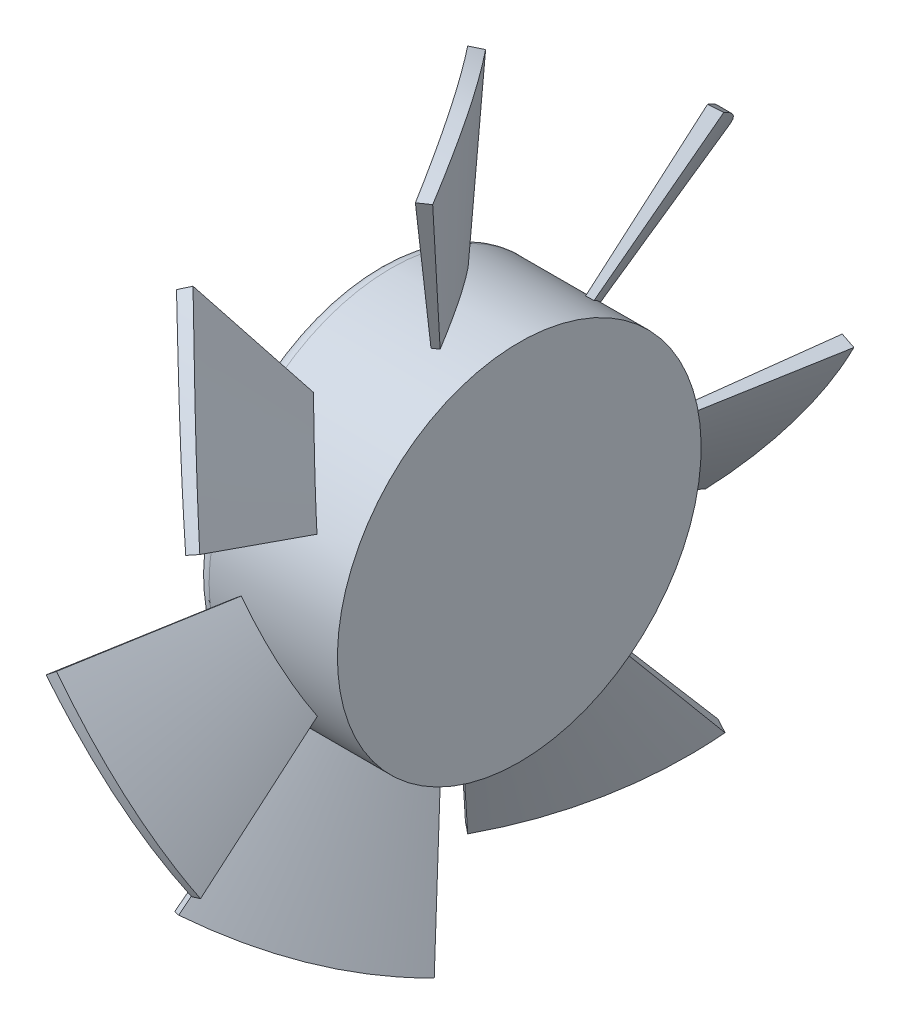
ISO-10303-21;
HEADER;
FILE_DESCRIPTION(('STEP AP214'),'2;1');
FILE_NAME('part.step','',(''),(''),'','','');
FILE_SCHEMA(('AUTOMOTIVE_DESIGN { 1 0 10303 214 1 1 1 1 }'));
ENDSEC;
DATA;
#1=APPLICATION_CONTEXT('core data for automotive mechanical design processes');
#2=APPLICATION_PROTOCOL_DEFINITION('international standard','automotive_design',2000,#1);
#3=PRODUCT_CONTEXT('',#1,'mechanical');
#4=PRODUCT('Part','Part','',(#3));
#5=PRODUCT_RELATED_PRODUCT_CATEGORY('part','',(#4));
#6=PRODUCT_DEFINITION_FORMATION('','',#4);
#7=PRODUCT_DEFINITION_CONTEXT('part definition',#1,'design');
#8=PRODUCT_DEFINITION('design','',#6,#7);
#9=PRODUCT_DEFINITION_SHAPE('','',#8);
#10=(LENGTH_UNIT() NAMED_UNIT(*) SI_UNIT(.MILLI.,.METRE.));
#11=(NAMED_UNIT(*) PLANE_ANGLE_UNIT() SI_UNIT($,.RADIAN.));
#12=(NAMED_UNIT(*) SI_UNIT($,.STERADIAN.) SOLID_ANGLE_UNIT());
#13=UNCERTAINTY_MEASURE_WITH_UNIT(LENGTH_MEASURE(1.E-05),#10,'distance_accuracy_value','');
#14=(GEOMETRIC_REPRESENTATION_CONTEXT(3) GLOBAL_UNCERTAINTY_ASSIGNED_CONTEXT((#13)) GLOBAL_UNIT_ASSIGNED_CONTEXT((#10,
#11,#12)) REPRESENTATION_CONTEXT('',''));
#15=CARTESIAN_POINT('',(0.,0.,0.));
#16=DIRECTION('',(0.,0.,1.));
#17=DIRECTION('',(1.,0.,0.));
#18=AXIS2_PLACEMENT_3D('',#15,#16,#17);
#19=CARTESIAN_POINT('',(-6.92856685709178,52.,12.9338367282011));
#20=CARTESIAN_POINT('',(-14.7,0.,0.));
#21=CARTESIAN_POINT('',(-11.6619667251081,52.,4.03160632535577));
#22=CARTESIAN_POINT('',(-14.7,0.,0.));
#23=CARTESIAN_POINT('',(-17.2999729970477,52.,-4.32708171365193));
#24=CARTESIAN_POINT('',(-14.7,0.,0.));
#25=CARTESIAN_POINT('',(-23.7808144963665,52.,-12.0506478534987));
#26=CARTESIAN_POINT('',(-14.7,0.,0.));
#27=(BOUNDED_SURFACE() B_SPLINE_SURFACE(3,1,((#19,#20),(#21,#22),(#23,#24),(#25,#26)),
.UNSPECIFIED.,.F.,.F.,.F.) B_SPLINE_SURFACE_WITH_KNOTS((4,4),(2,2),(0.,1.),(0.,1.),
.UNSPECIFIED.) GEOMETRIC_REPRESENTATION_ITEM() RATIONAL_B_SPLINE_SURFACE(((1.,1.),
(0.996347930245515,0.996347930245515),(0.996347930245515,0.996347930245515),(1.,1.))) REPRESENTATION_ITEM('') SURFACE());
#28=DIRECTION('',(0.143530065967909,0.960384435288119,0.23887414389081));
#29=VECTOR('',#28,1.);
#30=CARTESIAN_POINT('',(-10.8142834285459,26.,6.46691836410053));
#31=LINE('',#30,#29);
#32=CARTESIAN_POINT('',(-10.711627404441,26.6868891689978,6.63776667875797));
#33=VERTEX_POINT('',#32);
#34=CARTESIAN_POINT('',(-7.15835000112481,50.4624813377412,12.5514133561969));
#35=VERTEX_POINT('',#34);
#36=EDGE_CURVE('E301',#33,#35,#31,.T.);
#37=CARTESIAN_POINT('',(-7.15835000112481,50.4624813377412,12.5514133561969));
#38=CARTESIAN_POINT('',(-7.44647257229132,50.5983493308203,12.0051511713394));
#39=CARTESIAN_POINT('',(-7.73975884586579,50.7246968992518,11.4593165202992));
#40=CARTESIAN_POINT('',(-8.33609811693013,50.9587470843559,10.3690416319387));
#41=CARTESIAN_POINT('',(-8.63915033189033,51.0664511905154,9.82460128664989));
#42=CARTESIAN_POINT('',(-9.56151433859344,51.3620072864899,8.19523508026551));
#43=CARTESIAN_POINT('',(-10.1946642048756,51.5225975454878,7.11307058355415));
#44=CARTESIAN_POINT('',(-11.4935729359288,51.7741463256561,4.96098033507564));
#45=CARTESIAN_POINT('',(-12.1593211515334,51.8651274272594,3.89105072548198));
#46=CARTESIAN_POINT('',(-13.5209908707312,51.9809026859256,1.76598295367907));
#47=CARTESIAN_POINT('',(-14.2169316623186,52.005653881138,0.71085483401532));
#48=CARTESIAN_POINT('',(-15.599537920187,51.9925372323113,-1.32659574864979));
#49=CARTESIAN_POINT('',(-16.2848375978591,51.9578263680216,-2.30987058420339));
#50=CARTESIAN_POINT('',(-17.6784912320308,51.8346513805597,-4.25683048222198));
#51=CARTESIAN_POINT('',(-18.3868508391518,51.7461739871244,-5.22051064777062));
#52=CARTESIAN_POINT('',(-19.8250838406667,51.5184621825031,-7.12513299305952));
#53=CARTESIAN_POINT('',(-20.5549508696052,51.3792426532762,-8.06608175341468));
#54=CARTESIAN_POINT('',(-21.6652307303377,51.1347243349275,-9.45843471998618));
#55=CARTESIAN_POINT('',(-22.0378415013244,51.0472873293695,-9.91929996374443));
#56=CARTESIAN_POINT('',(-22.7882329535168,50.8609191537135,-10.8344334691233));
#57=CARTESIAN_POINT('',(-23.1660135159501,50.7619882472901,-11.288701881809));
#58=CARTESIAN_POINT('',(-23.5463740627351,50.6575100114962,-11.7395348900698));
#59=B_SPLINE_CURVE_WITH_KNOTS('',3,(#37,#38,#39,#40,#41,#42,#43,#44,#45,#46,#47,#48,#49,#50,#51,
#52,#53,#54,#55,#56,#57,#58),.UNSPECIFIED.,.F.,.F.,(4,2,2,2,2,2,2,2,2,2,4),(0.,1.89686945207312,
3.79358728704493,7.58288619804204,11.370955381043,15.1614812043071,18.7569372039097,
22.353280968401,25.9485708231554,27.7456261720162,29.5426403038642),.UNSPECIFIED.);
#60=CARTESIAN_POINT('',(-23.5463740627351,50.6575100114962,-11.7395348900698));
#61=VERTEX_POINT('',#60);
#62=EDGE_CURVE('E678',#35,#61,#59,.T.);
#63=DIRECTION('',(0.167712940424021,-0.96038443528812,0.22256258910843));
#64=VECTOR('',#63,1.);
#65=CARTESIAN_POINT('',(-19.2404072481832,26.,-6.02532392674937));
#66=LINE('',#65,#64);
#67=CARTESIAN_POINT('',(-19.3783708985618,26.7900293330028,-6.20840787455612));
#68=VERTEX_POINT('',#67);
#69=EDGE_CURVE('E302',#61,#68,#66,.T.);
#70=CARTESIAN_POINT('',(-10.711627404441,26.6868891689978,6.63776667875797));
#71=CARTESIAN_POINT('',(-11.0010611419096,26.8233587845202,6.08909124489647));
#72=CARTESIAN_POINT('',(-11.3002866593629,26.9416644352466,5.54122110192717));
#73=CARTESIAN_POINT('',(-11.9163801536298,27.1433823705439,4.44915987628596));
#74=CARTESIAN_POINT('',(-12.2332434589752,27.2268038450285,3.90496786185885));
#75=CARTESIAN_POINT('',(-12.8818412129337,27.3600560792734,2.82368179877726));
#76=CARTESIAN_POINT('',(-13.21352765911,27.4099879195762,2.2865712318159));
#77=CARTESIAN_POINT('',(-13.8912085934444,27.4781487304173,1.21948853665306));
#78=CARTESIAN_POINT('',(-14.2372022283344,27.4963795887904,0.689515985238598));
#79=CARTESIAN_POINT('',(-14.9597897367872,27.5027988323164,-0.387774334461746));
#80=CARTESIAN_POINT('',(-15.3370506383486,27.4894562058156,-0.934652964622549));
#81=CARTESIAN_POINT('',(-16.1050823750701,27.4312699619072,-2.01726797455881));
#82=CARTESIAN_POINT('',(-16.4958559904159,27.3864198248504,-2.55300202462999));
#83=CARTESIAN_POINT('',(-17.2946333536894,27.2663258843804,-3.61768853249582));
#84=CARTESIAN_POINT('',(-17.7027837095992,27.1907379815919,-4.14649182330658));
#85=CARTESIAN_POINT('',(-18.531410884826,27.0111744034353,-5.18906887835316));
#86=CARTESIAN_POINT('',(-18.9518825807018,26.907210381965,-5.70284871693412));
#87=CARTESIAN_POINT('',(-19.3783708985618,26.7900293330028,-6.20840787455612));
#88=B_SPLINE_CURVE_WITH_KNOTS('',3,(#70,#71,#72,#73,#74,#75,#76,#77,#78,#79,#80,#81,#82,#83,#84,
#85,#86,#87),.UNSPECIFIED.,.F.,.F.,(4,2,2,2,2,2,2,2,4),(0.,1.90497576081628,3.80944935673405,
5.70814856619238,7.60673470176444,9.59925548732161,11.5921886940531,13.6080748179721,
15.6231342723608),.UNSPECIFIED.);
#89=EDGE_CURVE('E673',#33,#68,#88,.T.);
#90=ORIENTED_EDGE('',*,*,#36,.T.);
#91=ORIENTED_EDGE('',*,*,#62,.T.);
#92=ORIENTED_EDGE('',*,*,#69,.T.);
#93=ORIENTED_EDGE('',*,*,#89,.F.);
#94=EDGE_LOOP('',(#90,#91,#92,#93));
#95=FACE_BOUND('',#94,.T.);
#96=ADVANCED_FACE('F39',(#95),#27,.T.);
#97=CARTESIAN_POINT('',(-22.2487256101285,52.,-13.3362230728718));
#98=DIRECTION('',(-0.617388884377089,-0.278326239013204,-0.735775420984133));
#99=DIRECTION('',(-0.76604444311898,0.,0.642787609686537));
#100=AXIS2_PLACEMENT_3D('',#97,#98,#99);
#101=PLANE('',#100);
#102=ORIENTED_EDGE('',*,*,#69,.F.);
#103=CARTESIAN_POINT('',(-14.7,0.,0.));
#104=DIRECTION('',(-0.617388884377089,-0.278326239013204,-0.735775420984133));
#105=DIRECTION('',(0.786658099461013,-0.218437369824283,-0.577454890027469));
#106=AXIS2_PLACEMENT_3D('',#103,#104,#105);
#107=ELLIPSE('',#106,84.2256822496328,52.);
#108=CARTESIAN_POINT('',(-22.0120799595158,50.3698475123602,-12.9181446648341));
#109=VERTEX_POINT('',#108);
#110=EDGE_CURVE('E354',#61,#109,#107,.T.);
#111=ORIENTED_EDGE('',*,*,#110,.T.);
#112=DIRECTION('',(0.13924698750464,-0.959214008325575,0.246005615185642));
#113=VECTOR('',#112,1.);
#114=CARTESIAN_POINT('',(-22.2487256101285,52.,-13.3362230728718));
#115=LINE('',#114,#113);
#116=CARTESIAN_POINT('',(-18.5669653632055,26.6379001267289,-6.83171112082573));
#117=VERTEX_POINT('',#116);
#118=EDGE_CURVE('E299',#109,#117,#115,.T.);
#119=ORIENTED_EDGE('',*,*,#118,.T.);
#120=CARTESIAN_POINT('',(-14.7,0.,0.));
#121=DIRECTION('',(-0.617388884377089,-0.278326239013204,-0.735775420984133));
#122=DIRECTION('',(-0.786658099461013,0.218437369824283,0.577454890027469));
#123=AXIS2_PLACEMENT_3D('',#120,#121,#122);
#124=ELLIPSE('',#123,44.5424281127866,27.5);
#125=EDGE_CURVE('E695',#68,#117,#124,.T.);
#126=ORIENTED_EDGE('',*,*,#125,.F.);
#127=EDGE_LOOP('',(#102,#111,#119,#126));
#128=FACE_BOUND('',#127,.T.);
#129=ADVANCED_FACE('F653',(#128),#101,.T.);
#130=CARTESIAN_POINT('',(-6.92856685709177,52.,12.9338367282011));
#131=DIRECTION('',(0.45092114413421,-0.278326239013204,0.848059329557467));
#132=DIRECTION('',(0.882947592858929,0.,-0.469471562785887));
#133=AXIS2_PLACEMENT_3D('',#130,#131,#132);
#134=PLANE('',#133);
#135=DIRECTION('',(-0.175929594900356,-0.959214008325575,-0.221262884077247));
#136=VECTOR('',#135,1.);
#137=CARTESIAN_POINT('',(-5.16267167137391,52.,11.9948936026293));
#138=LINE('',#137,#136);
#139=CARTESIAN_POINT('',(-5.40671133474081,50.6694321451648,11.6879701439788));
#140=VERTEX_POINT('',#139);
#141=CARTESIAN_POINT('',(-9.78528003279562,26.7963343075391,6.18113805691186));
#142=VERTEX_POINT('',#141);
#143=EDGE_CURVE('E295',#140,#142,#138,.T.);
#144=ORIENTED_EDGE('',*,*,#143,.F.);
#145=CARTESIAN_POINT('',(-14.7,0.,0.));
#146=DIRECTION('',(0.45092114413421,-0.278326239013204,0.848059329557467));
#147=DIRECTION('',(0.892563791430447,0.140609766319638,-0.428437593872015));
#148=AXIS2_PLACEMENT_3D('',#145,#146,#147);
#149=ELLIPSE('',#148,115.319498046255,52.);
#150=EDGE_CURVE('E357',#140,#35,#149,.T.);
#151=ORIENTED_EDGE('',*,*,#150,.T.);
#152=ORIENTED_EDGE('',*,*,#36,.F.);
#153=CARTESIAN_POINT('',(-14.7,0.,0.));
#154=DIRECTION('',(0.45092114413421,-0.278326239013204,0.848059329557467));
#155=DIRECTION('',(-0.892563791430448,-0.140609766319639,0.428437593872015));
#156=AXIS2_PLACEMENT_3D('',#153,#154,#155);
#157=ELLIPSE('',#156,60.9862730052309,27.5);
#158=EDGE_CURVE('E322',#142,#33,#157,.T.);
#159=ORIENTED_EDGE('',*,*,#158,.F.);
#160=EDGE_LOOP('',(#144,#151,#152,#159));
#161=FACE_BOUND('',#160,.T.);
#162=ADVANCED_FACE('F335',(#161),#134,.T.);
#163=CARTESIAN_POINT('',(-22.2487256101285,52.,-13.3362230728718));
#164=CARTESIAN_POINT('',(-14.7,0.,0.));
#165=CARTESIAN_POINT('',(-15.677969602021,52.,-5.5055009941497));
#166=CARTESIAN_POINT('',(-14.7,0.,0.));
#167=CARTESIAN_POINT('',(-9.96174222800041,52.,2.96915459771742));
#168=CARTESIAN_POINT('',(-14.7,0.,0.));
#169=CARTESIAN_POINT('',(-5.16267167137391,52.,11.9948936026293));
#170=CARTESIAN_POINT('',(-14.7,0.,0.));
#171=(BOUNDED_SURFACE() B_SPLINE_SURFACE(3,1,((#163,#164),(#165,#166),(#167,#168),(#169,#170)),
.UNSPECIFIED.,.F.,.F.,.F.) B_SPLINE_SURFACE_WITH_KNOTS((4,4),(2,2),(0.,1.),(0.,1.),
.UNSPECIFIED.) GEOMETRIC_REPRESENTATION_ITEM() RATIONAL_B_SPLINE_SURFACE(((1.,1.),
(0.996347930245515,0.996347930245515),(0.996347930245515,0.996347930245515),(1.,1.))) REPRESENTATION_ITEM('') SURFACE());
#172=CARTESIAN_POINT('',(-22.0120799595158,50.3698475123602,-12.9181446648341));
#173=CARTESIAN_POINT('',(-21.6033581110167,50.4921555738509,-12.4412499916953));
#174=CARTESIAN_POINT('',(-21.1976670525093,50.6083058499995,-11.9602115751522));
#175=CARTESIAN_POINT('',(-20.3923697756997,50.8277830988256,-10.9901666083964));
#176=CARTESIAN_POINT('',(-19.9927636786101,50.9311098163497,-10.5011598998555));
#177=CARTESIAN_POINT('',(-18.8028380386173,51.2211576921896,-9.02232985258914));
#178=CARTESIAN_POINT('',(-18.0217141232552,51.3878551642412,-8.021050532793));
#179=CARTESIAN_POINT('',(-16.4851008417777,51.663879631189,-5.99108548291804));
#180=CARTESIAN_POINT('',(-15.7296150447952,51.7731986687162,-4.96239597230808));
#181=CARTESIAN_POINT('',(-14.2461208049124,51.9306103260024,-2.88107265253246));
#182=CARTESIAN_POINT('',(-13.5181060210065,51.9787171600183,-1.82844446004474));
#183=CARTESIAN_POINT('',(-12.129077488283,52.0091933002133,0.241750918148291));
#184=CARTESIAN_POINT('',(-11.4665532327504,51.9948841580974,1.25825385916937));
#185=CARTESIAN_POINT('',(-10.170351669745,51.9048702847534,3.30694348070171));
#186=CARTESIAN_POINT('',(-9.53667596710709,51.8291621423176,4.33913102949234));
#187=CARTESIAN_POINT('',(-8.29910024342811,51.6128841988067,6.41926377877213));
#188=CARTESIAN_POINT('',(-7.69530338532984,51.4721049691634,7.46724920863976));
#189=CARTESIAN_POINT('',(-6.81634951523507,51.2099608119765,9.04569611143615));
#190=CARTESIAN_POINT('',(-6.52776754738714,51.1140596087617,9.57302779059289));
#191=CARTESIAN_POINT('',(-5.96003585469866,50.9048764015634,10.6293655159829));
#192=CARTESIAN_POINT('',(-5.680886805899,50.7915931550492,11.1583716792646));
#193=CARTESIAN_POINT('',(-5.40671133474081,50.6694321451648,11.6879701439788));
#194=B_SPLINE_CURVE_WITH_KNOTS('',3,(#172,#173,#174,#175,#176,#177,#178,#179,#180,#181,#182,
#183,#184,#185,#186,#187,#188,#189,#190,#191,#192,#193),.UNSPECIFIED.,.F.,.F.,(4,2,2,2,2,2,2,2,
2,2,4),(0.,1.91952501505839,3.83908821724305,7.67963729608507,11.520718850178,15.3609082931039,
18.9993026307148,22.6378991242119,26.2882887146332,28.114203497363,29.9402488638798),.UNSPECIFIED.);
#195=EDGE_CURVE('E54',#109,#140,#194,.T.);
#196=CARTESIAN_POINT('',(-18.5669653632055,26.6379001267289,-6.83171112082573));
#197=CARTESIAN_POINT('',(-18.1993005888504,26.747938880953,-6.40269738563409));
#198=CARTESIAN_POINT('',(-17.8362083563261,26.8485446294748,-5.96730485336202));
#199=CARTESIAN_POINT('',(-17.1193333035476,27.0296050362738,-5.08461753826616));
#200=CARTESIAN_POINT('',(-16.7655531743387,27.1100539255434,-4.63731938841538));
#201=CARTESIAN_POINT('',(-16.0674270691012,27.2495010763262,-3.73159811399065));
#202=CARTESIAN_POINT('',(-15.7230880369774,27.3084839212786,-3.27316724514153));
#203=CARTESIAN_POINT('',(-15.0446400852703,27.4036561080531,-2.3465955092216));
#204=CARTESIAN_POINT('',(-14.7105295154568,27.4398491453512,-1.8784562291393));
#205=CARTESIAN_POINT('',(-13.9612653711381,27.4949801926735,-0.801459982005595));
#206=CARTESIAN_POINT('',(-13.5495272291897,27.5062800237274,-0.189804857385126));
#207=CARTESIAN_POINT('',(-12.7456554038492,27.4870707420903,1.0450075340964));
#208=CARTESIAN_POINT('',(-12.353508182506,27.4565909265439,1.66815643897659));
#209=CARTESIAN_POINT('',(-11.5835789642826,27.3504023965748,2.935495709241));
#210=CARTESIAN_POINT('',(-11.2061948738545,27.2738705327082,3.57986220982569));
#211=CARTESIAN_POINT('',(-10.6588215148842,27.1226826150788,4.55168150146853));
#212=CARTESIAN_POINT('',(-10.4793662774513,27.0661712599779,4.87672027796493));
#213=CARTESIAN_POINT('',(-10.1271757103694,26.9406824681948,5.52807430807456));
#214=CARTESIAN_POINT('',(-9.95444112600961,26.8717036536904,5.85438969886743));
#215=CARTESIAN_POINT('',(-9.78528003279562,26.7963343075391,6.18113805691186));
#216=B_SPLINE_CURVE_WITH_KNOTS('',3,(#196,#197,#198,#199,#200,#201,#202,#203,#204,#205,#206,
#207,#208,#209,#210,#211,#212,#213,#214,#215),.UNSPECIFIED.,.F.,.F.,(4,2,2,2,2,2,2,2,2,4),(0.,
1.72677436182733,3.45404237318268,5.18254844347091,6.91077415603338,9.12148508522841,
11.3306465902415,13.5805196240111,14.7069749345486,15.8335548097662),.UNSPECIFIED.);
#217=EDGE_CURVE('E315',#117,#142,#216,.T.);
#218=ORIENTED_EDGE('',*,*,#118,.F.);
#219=ORIENTED_EDGE('',*,*,#195,.T.);
#220=ORIENTED_EDGE('',*,*,#143,.T.);
#221=ORIENTED_EDGE('',*,*,#217,.F.);
#222=EDGE_LOOP('',(#218,#219,#220,#221));
#223=FACE_BOUND('',#222,.T.);
#224=ADVANCED_FACE('F327',(#223),#171,.T.);
#225=CARTESIAN_POINT('',(-6.92856685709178,22.3093889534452,48.7193523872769));
#226=CARTESIAN_POINT('',(-14.7,0.,0.));
#227=CARTESIAN_POINT('',(-11.6619667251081,29.2694329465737,43.1689025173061));
#228=CARTESIAN_POINT('',(-14.7,0.,0.));
#229=CARTESIAN_POINT('',(-17.2999729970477,35.8045184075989,37.9573457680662));
#230=CARTESIAN_POINT('',(-14.7,0.,0.));
#231=CARTESIAN_POINT('',(-23.7808144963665,41.8430455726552,33.1417810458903));
#232=CARTESIAN_POINT('',(-14.7,0.,0.));
#233=(BOUNDED_SURFACE() B_SPLINE_SURFACE(3,1,((#225,#226),(#227,#228),(#229,#230),(#231,#232)),
.UNSPECIFIED.,.F.,.F.,.F.) B_SPLINE_SURFACE_WITH_KNOTS((4,4),(2,2),(0.,1.),(0.,1.),
.UNSPECIFIED.) GEOMETRIC_REPRESENTATION_ITEM() RATIONAL_B_SPLINE_SURFACE(((1.,1.),
(0.996347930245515,0.996347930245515),(0.996347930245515,0.996347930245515),(1.,1.))) REPRESENTATION_ITEM('') SURFACE());
#234=DIRECTION('',(0.143530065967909,0.412030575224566,0.899794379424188));
#235=VECTOR('',#234,1.);
#236=CARTESIAN_POINT('',(-10.8142834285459,11.1546944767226,24.3596761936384));
#237=LINE('',#236,#235);
#238=CARTESIAN_POINT('',(-10.711627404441,11.4493882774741,25.0032299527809));
#239=VERTEX_POINT('',#238);
#240=CARTESIAN_POINT('',(-7.15835000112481,21.6497523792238,47.2788348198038));
#241=VERTEX_POINT('',#240);
#242=EDGE_CURVE('E292',#239,#241,#237,.T.);
#243=CARTESIAN_POINT('',(-7.15835000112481,21.6497523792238,47.2788348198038));
#244=CARTESIAN_POINT('',(-7.44647257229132,22.161549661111,47.044471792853));
#245=CARTESIAN_POINT('',(-7.73975884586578,22.6670767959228,46.8029319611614));
#246=CARTESIAN_POINT('',(-8.33609811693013,23.6654159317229,46.3061444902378));
#247=CARTESIAN_POINT('',(-8.63915033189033,24.1582289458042,46.0508979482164));
#248=CARTESIAN_POINT('',(-9.56151433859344,25.6163949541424,45.2660797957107));
#249=CARTESIAN_POINT('',(-10.1946642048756,26.5625916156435,44.7169157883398));
#250=CARTESIAN_POINT('',(-11.4935729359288,28.4020016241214,43.5717782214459));
#251=CARTESIAN_POINT('',(-12.1593211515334,29.295232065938,42.9758199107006));
#252=CARTESIAN_POINT('',(-13.5209908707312,31.0288616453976,41.741378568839));
#253=CARTESIAN_POINT('',(-14.2169316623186,31.8692261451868,41.10286821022));
#254=CARTESIAN_POINT('',(-15.599537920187,33.4539910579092,39.82228354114));
#255=CARTESIAN_POINT('',(-16.2848375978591,34.2011044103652,39.1820836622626));
#256=CARTESIAN_POINT('',(-17.6784912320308,35.6465006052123,37.8718719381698));
#257=CARTESIAN_POINT('',(-18.3868508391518,36.3447713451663,37.2018527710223));
#258=CARTESIAN_POINT('',(-19.8250838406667,37.691889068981,35.8363079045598));
#259=CARTESIAN_POINT('',(-20.5549508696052,38.3407504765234,35.1407897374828));
#260=CARTESIAN_POINT('',(-21.6652307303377,39.2768811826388,34.0814997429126));
#261=CARTESIAN_POINT('',(-22.0378415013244,39.5826840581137,33.7257939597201));
#262=CARTESIAN_POINT('',(-22.7882329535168,40.1819655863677,33.0095090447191));
#263=CARTESIAN_POINT('',(-23.1660135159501,40.4754445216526,32.6489300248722));
#264=CARTESIAN_POINT('',(-23.5463740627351,40.7627788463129,32.2861558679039));
#265=B_SPLINE_CURVE_WITH_KNOTS('',3,(#243,#244,#245,#246,#247,#248,#249,#250,#251,#252,#253,
#254,#255,#256,#257,#258,#259,#260,#261,#262,#263,#264),.UNSPECIFIED.,.F.,.F.,(4,2,2,2,2,2,2,2,
2,2,4),(0.,1.89686945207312,3.79358728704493,7.58288619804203,11.370955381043,15.1614812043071,
18.7569372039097,22.353280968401,25.9485708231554,27.7456261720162,29.5426403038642),.UNSPECIFIED.);
#266=CARTESIAN_POINT('',(-23.5463740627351,40.7627788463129,32.2861558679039));
#267=VERTEX_POINT('',#266);
#268=EDGE_CURVE('E457',#241,#267,#265,.T.);
#269=DIRECTION('',(0.167712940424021,-0.772796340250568,-0.612093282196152));
#270=VECTOR('',#269,1.);
#271=CARTESIAN_POINT('',(-19.2404072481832,20.9215227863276,16.5708905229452));
#272=LINE('',#271,#270);
#273=CARTESIAN_POINT('',(-19.3783708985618,21.5572388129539,17.0744093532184));
#274=VERTEX_POINT('',#273);
#275=EDGE_CURVE('E293',#267,#274,#272,.T.);
#276=CARTESIAN_POINT('',(-10.711627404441,11.4493882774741,25.0032299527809));
#277=CARTESIAN_POINT('',(-11.0010611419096,11.9634474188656,24.7678326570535));
#278=CARTESIAN_POINT('',(-11.3002866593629,12.4655519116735,24.5187362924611));
#279=CARTESIAN_POINT('',(-11.9163801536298,13.4451288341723,23.9955566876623));
#280=CARTESIAN_POINT('',(-12.2332434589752,13.9226077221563,23.72148005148));
#281=CARTESIAN_POINT('',(-12.8818412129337,14.8510726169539,23.1514900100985));
#282=CARTESIAN_POINT('',(-13.21352765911,15.3021345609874,22.8556453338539));
#283=CARTESIAN_POINT('',(-13.8912085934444,16.1789109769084,22.243620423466));
#284=CARTESIAN_POINT('',(-14.2372022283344,16.6046269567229,21.9274414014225));
#285=CARTESIAN_POINT('',(-14.9597897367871,17.4508887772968,21.2607806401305));
#286=CARTESIAN_POINT('',(-15.3370506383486,17.8701367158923,20.9093757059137));
#287=CARTESIAN_POINT('',(-16.1050823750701,18.6802806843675,20.1888844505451));
#288=CARTESIAN_POINT('',(-16.4958559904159,19.0711708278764,19.8197944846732));
#289=CARTESIAN_POINT('',(-17.2946333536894,19.8286989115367,19.0620800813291));
#290=CARTESIAN_POINT('',(-17.7027837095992,20.1950056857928,18.6732796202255));
#291=CARTESIAN_POINT('',(-18.531410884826,20.8981691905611,17.8828550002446));
#292=CARTESIAN_POINT('',(-18.9518825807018,21.2350379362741,17.4812361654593));
#293=CARTESIAN_POINT('',(-19.3783708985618,21.5572388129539,17.0744093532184));
#294=B_SPLINE_CURVE_WITH_KNOTS('',3,(#276,#277,#278,#279,#280,#281,#282,#283,#284,#285,#286,
#287,#288,#289,#290,#291,#292,#293),.UNSPECIFIED.,.F.,.F.,(4,2,2,2,2,2,2,2,4),(0.,
1.90497576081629,3.80944935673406,5.70814856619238,7.60673470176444,9.59925548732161,
11.5921886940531,13.6080748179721,15.6231342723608),.UNSPECIFIED.);
#295=EDGE_CURVE('E717',#239,#274,#294,.T.);
#296=ORIENTED_EDGE('',*,*,#242,.T.);
#297=ORIENTED_EDGE('',*,*,#268,.T.);
#298=ORIENTED_EDGE('',*,*,#275,.T.);
#299=ORIENTED_EDGE('',*,*,#295,.F.);
#300=EDGE_LOOP('',(#296,#297,#298,#299));
#301=FACE_BOUND('',#300,.T.);
#302=ADVANCED_FACE('F334',(#301),#233,.T.);
#303=CARTESIAN_POINT('',(-22.2487256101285,42.8481487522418,32.3402380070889));
#304=DIRECTION('',(-0.61738888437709,0.401718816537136,-0.676352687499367));
#305=DIRECTION('',(-0.76604444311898,-0.502551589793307,0.400771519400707));
#306=AXIS2_PLACEMENT_3D('',#303,#304,#305);
#307=PLANE('',#306);
#308=ORIENTED_EDGE('',*,*,#275,.F.);
#309=CARTESIAN_POINT('',(-14.7,0.,0.));
#310=DIRECTION('',(-0.61738888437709,0.401718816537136,-0.676352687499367));
#311=DIRECTION('',(0.786658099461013,0.315278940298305,-0.53081844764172));
#312=AXIS2_PLACEMENT_3D('',#309,#310,#311);
#313=ELLIPSE('',#312,84.2256822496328,52.);
#314=CARTESIAN_POINT('',(-22.0120799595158,41.5048984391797,31.3264010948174));
#315=VERTEX_POINT('',#314);
#316=EDGE_CURVE('E355',#267,#315,#313,.T.);
#317=ORIENTED_EDGE('',*,*,#316,.T.);
#318=DIRECTION('',(0.13924698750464,-0.790395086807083,-0.596561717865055));
#319=VECTOR('',#318,1.);
#320=CARTESIAN_POINT('',(-22.2487256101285,42.8481487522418,32.3402380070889));
#321=LINE('',#320,#319);
#322=CARTESIAN_POINT('',(-18.5669653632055,21.9497059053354,16.5668467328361));
#323=VERTEX_POINT('',#322);
#324=EDGE_CURVE('E290',#315,#323,#321,.T.);
#325=ORIENTED_EDGE('',*,*,#324,.T.);
#326=CARTESIAN_POINT('',(-14.7,0.,0.));
#327=DIRECTION('',(-0.61738888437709,0.401718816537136,-0.676352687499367));
#328=DIRECTION('',(-0.786658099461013,-0.315278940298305,0.53081844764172));
#329=AXIS2_PLACEMENT_3D('',#326,#327,#328);
#330=ELLIPSE('',#329,44.5424281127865,27.5);
#331=EDGE_CURVE('E716',#274,#323,#330,.T.);
#332=ORIENTED_EDGE('',*,*,#331,.F.);
#333=EDGE_LOOP('',(#308,#317,#325,#332));
#334=FACE_BOUND('',#333,.T.);
#335=ADVANCED_FACE('F704',(#334),#307,.T.);
#336=CARTESIAN_POINT('',(-6.92856685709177,22.3093889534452,48.7193523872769));
#337=DIRECTION('',(0.45092114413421,-0.836573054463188,0.311152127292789));
#338=DIRECTION('',(0.882947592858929,0.367047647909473,-0.292710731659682));
#339=AXIS2_PLACEMENT_3D('',#336,#337,#338);
#340=PLANE('',#339);
#341=DIRECTION('',(-0.175929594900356,-0.425069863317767,-0.8878988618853));
#342=VECTOR('',#341,1.);
#343=CARTESIAN_POINT('',(-5.16267167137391,23.0434842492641,48.1339309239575));
#344=LINE('',#343,#342);
#345=CARTESIAN_POINT('',(-5.4067113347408,22.4538511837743,46.9022874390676));
#346=VERTEX_POINT('',#345);
#347=CARTESIAN_POINT('',(-9.78528003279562,11.8746328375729,24.8040943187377));
#348=VERTEX_POINT('',#347);
#349=EDGE_CURVE('E286',#346,#348,#344,.T.);
#350=ORIENTED_EDGE('',*,*,#349,.F.);
#351=CARTESIAN_POINT('',(-14.7,0.,0.));
#352=DIRECTION('',(0.45092114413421,-0.836573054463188,0.311152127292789));
#353=DIRECTION('',(0.892563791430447,0.422634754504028,-0.157193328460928));
#354=AXIS2_PLACEMENT_3D('',#351,#352,#353);
#355=ELLIPSE('',#354,115.319498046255,52.);
#356=EDGE_CURVE('E462',#346,#241,#355,.T.);
#357=ORIENTED_EDGE('',*,*,#356,.T.);
#358=ORIENTED_EDGE('',*,*,#242,.F.);
#359=CARTESIAN_POINT('',(-14.7,0.,0.));
#360=DIRECTION('',(0.45092114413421,-0.836573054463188,0.311152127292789));
#361=DIRECTION('',(-0.892563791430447,-0.422634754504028,0.157193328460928));
#362=AXIS2_PLACEMENT_3D('',#359,#360,#361);
#363=ELLIPSE('',#362,60.9862730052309,27.5);
#364=EDGE_CURVE('E714',#348,#239,#363,.T.);
#365=ORIENTED_EDGE('',*,*,#364,.F.);
#366=EDGE_LOOP('',(#350,#357,#358,#365));
#367=FACE_BOUND('',#366,.T.);
#368=ADVANCED_FACE('F993',(#367),#340,.T.);
#369=CARTESIAN_POINT('',(-22.2487256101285,42.8481487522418,32.3402380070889));
#370=CARTESIAN_POINT('',(-14.7,0.,0.));
#371=CARTESIAN_POINT('',(-15.677969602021,36.7258437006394,37.2226133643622));
#372=CARTESIAN_POINT('',(-14.7,0.,0.));
#373=CARTESIAN_POINT('',(-9.9617422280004,30.1000911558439,42.5064747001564));
#374=CARTESIAN_POINT('',(-14.7,0.,0.));
#375=CARTESIAN_POINT('',(-5.16267167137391,23.0434842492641,48.1339309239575));
#376=CARTESIAN_POINT('',(-14.7,0.,0.));
#377=(BOUNDED_SURFACE() B_SPLINE_SURFACE(3,1,((#369,#370),(#371,#372),(#373,#374),(#375,#376)),
.UNSPECIFIED.,.F.,.F.,.F.) B_SPLINE_SURFACE_WITH_KNOTS((4,4),(2,2),(0.,1.),(0.,1.),
.UNSPECIFIED.) GEOMETRIC_REPRESENTATION_ITEM() RATIONAL_B_SPLINE_SURFACE(((1.,1.),
(0.996347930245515,0.996347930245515),(0.996347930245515,0.996347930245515),(1.,1.))) REPRESENTATION_ITEM('') SURFACE());
#378=CARTESIAN_POINT('',(-22.0120799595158,41.5048984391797,31.3264010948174));
#379=CARTESIAN_POINT('',(-21.6033581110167,41.2083049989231,31.7193643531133));
#380=CARTESIAN_POINT('',(-21.1976670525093,40.9046325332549,32.1100968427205));
#381=CARTESIAN_POINT('',(-20.3923697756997,40.2830626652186,32.8865042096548));
#382=CARTESIAN_POINT('',(-19.9927636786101,39.9651649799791,33.272178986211));
#383=CARTESIAN_POINT('',(-18.8028380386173,38.9898109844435,34.4209830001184));
#384=CARTESIAN_POINT('',(-18.0217141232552,38.3109134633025,35.1755997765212));
#385=CARTESIAN_POINT('',(-16.4851008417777,36.8959213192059,36.6570669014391));
#386=CARTESIAN_POINT('',(-15.7296150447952,36.1598187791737,37.3839133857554));
#387=CARTESIAN_POINT('',(-14.2461208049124,34.6307192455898,38.80466663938));
#388=CARTESIAN_POINT('',(-13.5181060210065,33.8377355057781,39.4985810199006));
#389=CARTESIAN_POINT('',(-12.129077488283,32.2381931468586,40.8131539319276));
#390=CARTESIAN_POINT('',(-11.4665532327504,31.4345375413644,41.4357458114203));
#391=CARTESIAN_POINT('',(-10.170351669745,29.7766847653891,42.6427072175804));
#392=CARTESIAN_POINT('',(-9.53667596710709,28.9224847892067,43.2270746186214));
#393=CARTESIAN_POINT('',(-8.29910024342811,27.1613244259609,44.3549232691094));
#394=CARTESIAN_POINT('',(-7.69530338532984,26.2542020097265,44.8982658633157));
#395=CARTESIAN_POINT('',(-6.81634951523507,24.8566783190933,45.677458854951));
#396=CARTESIAN_POINT('',(-6.52776754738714,24.3846003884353,45.9312661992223));
#397=CARTESIAN_POINT('',(-5.96003585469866,23.4282987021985,46.4263359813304));
#398=CARTESIAN_POINT('',(-5.680886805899,22.9440740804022,46.667597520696));
#399=CARTESIAN_POINT('',(-5.40671133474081,22.4538511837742,46.9022874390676));
#400=B_SPLINE_CURVE_WITH_KNOTS('',3,(#378,#379,#380,#381,#382,#383,#384,#385,#386,#387,#388,
#389,#390,#391,#392,#393,#394,#395,#396,#397,#398,#399),.UNSPECIFIED.,.F.,.F.,(4,2,2,2,2,2,2,2,
2,2,4),(0.,1.9195250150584,3.83908821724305,7.67963729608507,11.5207188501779,15.3609082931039,
18.9993026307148,22.6378991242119,26.2882887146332,28.114203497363,29.9402488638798),.UNSPECIFIED.);
#401=EDGE_CURVE('E62',#315,#346,#400,.T.);
#402=CARTESIAN_POINT('',(-18.5669653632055,21.9497059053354,16.5668467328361));
#403=CARTESIAN_POINT('',(-18.1993005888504,21.6828975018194,16.9203641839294));
#404=CARTESIAN_POINT('',(-17.8362083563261,21.4052205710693,17.2704837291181));
#405=CARTESIAN_POINT('',(-17.1193333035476,20.8279971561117,17.9623889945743));
#406=CARTESIAN_POINT('',(-16.7655531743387,20.5284444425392,18.3041723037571));
#407=CARTESIAN_POINT('',(-16.0674270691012,19.9072669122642,18.9779044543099));
#408=CARTESIAN_POINT('',(-15.7230880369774,19.5856264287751,19.3098460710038));
#409=CARTESIAN_POINT('',(-15.0446400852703,18.9205423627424,19.9619627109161));
#410=CARTESIAN_POINT('',(-14.7105295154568,18.5771023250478,20.2821396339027));
#411=CARTESIAN_POINT('',(-13.9612653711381,17.76944639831,20.9967389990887));
#412=CARTESIAN_POINT('',(-13.5495272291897,17.2982804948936,21.3869342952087));
#413=CARTESIAN_POINT('',(-12.7456554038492,16.32088850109,22.1418088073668));
#414=CARTESIAN_POINT('',(-12.353508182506,15.8146872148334,22.506505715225));
#415=CARTESIAN_POINT('',(-11.5835789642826,14.7576340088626,23.2136572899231));
#416=CARTESIAN_POINT('',(-11.2061948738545,14.2061311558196,23.5555782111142));
#417=CARTESIAN_POINT('',(-10.6588215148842,13.3520681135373,24.0432941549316));
#418=CARTESIAN_POINT('',(-10.4793662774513,13.0627083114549,24.201770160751));
#419=CARTESIAN_POINT('',(-10.1271757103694,12.4752182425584,24.509771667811));
#420=CARTESIAN_POINT('',(-9.95444112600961,12.1770870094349,24.659296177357));
#421=CARTESIAN_POINT('',(-9.78528003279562,11.8746328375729,24.8040943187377));
#422=B_SPLINE_CURVE_WITH_KNOTS('',3,(#402,#403,#404,#405,#406,#407,#408,#409,#410,#411,#412,
#413,#414,#415,#416,#417,#418,#419,#420,#421),.UNSPECIFIED.,.F.,.F.,(4,2,2,2,2,2,2,2,2,4),(0.,
1.72677436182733,3.45404237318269,5.18254844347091,6.91077415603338,9.12148508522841,
11.3306465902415,13.5805196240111,14.7069749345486,15.8335548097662),.UNSPECIFIED.);
#423=EDGE_CURVE('E697',#323,#348,#422,.T.);
#424=ORIENTED_EDGE('',*,*,#324,.F.);
#425=ORIENTED_EDGE('',*,*,#401,.T.);
#426=ORIENTED_EDGE('',*,*,#349,.T.);
#427=ORIENTED_EDGE('',*,*,#423,.F.);
#428=EDGE_LOOP('',(#424,#425,#426,#427));
#429=FACE_BOUND('',#428,.T.);
#430=ADVANCED_FACE('F708',(#429),#377,.T.);
#431=CARTESIAN_POINT('',(-6.92856685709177,-24.1806470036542,47.8182020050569));
#432=CARTESIAN_POINT('',(-14.7,0.,0.));
#433=CARTESIAN_POINT('',(-11.6619667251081,-15.5016141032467,49.7991346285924));
#434=CARTESIAN_POINT('',(-14.7,0.,0.));
#435=CARTESIAN_POINT('',(-17.2999729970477,-7.35249582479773,51.6591176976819));
#436=CARTESIAN_POINT('',(-14.7,0.,0.));
#437=CARTESIAN_POINT('',(-23.7808144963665,0.17742438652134,53.377772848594));
#438=CARTESIAN_POINT('',(-14.7,0.,0.));
#439=(BOUNDED_SURFACE() B_SPLINE_SURFACE(3,1,((#431,#432),(#433,#434),(#435,#436),(#437,#438)),
.UNSPECIFIED.,.F.,.F.,.F.) B_SPLINE_SURFACE_WITH_KNOTS((4,4),(2,2),(0.,1.),(0.,1.),
.UNSPECIFIED.) GEOMETRIC_REPRESENTATION_ITEM() RATIONAL_B_SPLINE_SURFACE(((1.,1.),
(0.996347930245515,0.996347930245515),(0.996347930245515,0.996347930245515),(1.,1.))) REPRESENTATION_ITEM('') SURFACE());
#440=DIRECTION('',(0.143530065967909,-0.446590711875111,0.883151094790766));
#441=VECTOR('',#440,1.);
#442=CARTESIAN_POINT('',(-10.8142834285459,-12.0903235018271,23.9091010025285));
#443=LINE('',#442,#441);
#444=CARTESIAN_POINT('',(-10.711627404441,-12.4097355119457,24.5407510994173));
#445=VERTEX_POINT('',#444);
#446=CARTESIAN_POINT('',(-7.1583500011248,-23.4656816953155,46.4043293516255));
#447=VERTEX_POINT('',#446);
#448=EDGE_CURVE('E283',#445,#447,#443,.T.);
#449=CARTESIAN_POINT('',(-7.1583500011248,-23.4656816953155,46.4043293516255));
#450=CARTESIAN_POINT('',(-7.44647257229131,-22.9633489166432,46.6583456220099));
#451=CARTESIAN_POINT('',(-7.73975884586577,-22.4593144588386,46.9029850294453));
#452=CARTESIAN_POINT('',(-8.33609811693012,-21.4484561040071,47.3737760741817));
#453=CARTESIAN_POINT('',(-8.63915033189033,-20.9416324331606,47.5999291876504));
#454=CARTESIAN_POINT('',(-9.56151433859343,-19.4188852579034,48.2506431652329));
#455=CARTESIAN_POINT('',(-10.1946642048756,-18.3995875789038,48.648011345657));
#456=CARTESIAN_POINT('',(-11.4935729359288,-16.3574295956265,49.3721384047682));
#457=CARTESIAN_POINT('',(-12.1593211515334,-15.3345705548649,49.6989201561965));
#458=CARTESIAN_POINT('',(-13.5209908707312,-13.2885450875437,50.2846647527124));
#459=CARTESIAN_POINT('',(-14.2169316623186,-12.2653788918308,50.543583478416));
#460=CARTESIAN_POINT('',(-15.599537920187,-10.2760927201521,50.984171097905));
#461=CARTESIAN_POINT('',(-16.2848375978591,-9.30974674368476,51.1691297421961));
#462=CARTESIAN_POINT('',(-17.6784912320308,-7.38419218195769,51.4822823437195));
#463=CARTESIAN_POINT('',(-18.3868508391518,-6.42498541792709,51.6104622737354));
#464=CARTESIAN_POINT('',(-19.8250838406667,-4.51744528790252,51.8122780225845));
#465=CARTESIAN_POINT('',(-20.5549508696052,-3.56910881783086,51.8859298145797));
#466=CARTESIAN_POINT('',(-21.6652307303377,-2.15725460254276,51.9573697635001));
#467=CARTESIAN_POINT('',(-22.0378415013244,-1.68848764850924,51.9746771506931));
#468=CARTESIAN_POINT('',(-22.7882329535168,-0.754827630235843,51.9966179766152));
#469=CARTESIAN_POINT('',(-23.1660135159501,-0.289934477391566,52.0012517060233));
#470=CARTESIAN_POINT('',(-23.5463740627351,0.172843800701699,51.9997127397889));
#471=B_SPLINE_CURVE_WITH_KNOTS('',3,(#449,#450,#451,#452,#453,#454,#455,#456,#457,#458,#459,
#460,#461,#462,#463,#464,#465,#466,#467,#468,#469,#470),.UNSPECIFIED.,.F.,.F.,(4,2,2,2,2,2,2,2,
2,2,4),(0.,1.89686945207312,3.79358728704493,7.58288619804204,11.370955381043,15.1614812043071,
18.7569372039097,22.353280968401,25.9485708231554,27.7456261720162,29.5426403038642),.UNSPECIFIED.);
#472=CARTESIAN_POINT('',(-23.5463740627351,0.172843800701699,51.9997127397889));
#473=VERTEX_POINT('',#472);
#474=EDGE_CURVE('E444',#447,#473,#471,.T.);
#475=DIRECTION('',(0.167712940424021,-0.00327683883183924,-0.98583042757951));
#476=VECTOR('',#475,1.);
#477=CARTESIAN_POINT('',(-19.2404072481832,0.0887121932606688,26.688886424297));
#478=LINE('',#477,#476);
#479=CARTESIAN_POINT('',(-19.3783708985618,0.0914077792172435,27.4998480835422));
#480=VERTEX_POINT('',#479);
#481=EDGE_CURVE('E284',#473,#480,#478,.T.);
#482=CARTESIAN_POINT('',(-10.711627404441,-12.4097355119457,24.5407510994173));
#483=CARTESIAN_POINT('',(-11.0010611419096,-11.9051838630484,24.7958909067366));
#484=CARTESIAN_POINT('',(-11.3002866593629,-11.3973754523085,25.033142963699));
#485=CARTESIAN_POINT('',(-11.9163801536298,-10.3775809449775,25.4728098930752));
#486=CARTESIAN_POINT('',(-12.2332434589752,-9.86559598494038,25.6752339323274));
#487=CARTESIAN_POINT('',(-12.8818412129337,-8.84107143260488,26.0457540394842));
#488=CARTESIAN_POINT('',(-13.21352765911,-8.32853822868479,26.2139523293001));
#489=CARTESIAN_POINT('',(-13.8912085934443,-7.30337673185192,26.5178524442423));
#490=CARTESIAN_POINT('',(-14.2372022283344,-6.79074844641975,26.6535562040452));
#491=CARTESIAN_POINT('',(-14.9597897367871,-5.74189646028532,26.8995341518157));
#492=CARTESIAN_POINT('',(-15.3370506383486,-5.2057602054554,27.0082179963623));
#493=CARTESIAN_POINT('',(-16.1050823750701,-4.13734095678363,27.1923951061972));
#494=CARTESIAN_POINT('',(-16.4958559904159,-3.60505878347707,27.2678814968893));
#495=CARTESIAN_POINT('',(-17.2946333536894,-2.54034277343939,27.3877135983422));
#496=CARTESIAN_POINT('',(-17.7027837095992,-2.00797779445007,27.4316906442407));
#497=CARTESIAN_POINT('',(-18.531410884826,-0.951583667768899,27.488624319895));
#498=CARTESIAN_POINT('',(-18.9518825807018,-0.427551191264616,27.50159366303));
#499=CARTESIAN_POINT('',(-19.3783708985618,0.0914077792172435,27.4998480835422));
#500=B_SPLINE_CURVE_WITH_KNOTS('',3,(#482,#483,#484,#485,#486,#487,#488,#489,#490,#491,#492,
#493,#494,#495,#496,#497,#498,#499),.UNSPECIFIED.,.F.,.F.,(4,2,2,2,2,2,2,2,4),(0.,
1.90497576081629,3.80944935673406,5.70814856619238,7.60673470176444,9.5992554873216,
11.5921886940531,13.6080748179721,15.6231342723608),.UNSPECIFIED.);
#501=EDGE_CURVE('E771',#445,#480,#500,.T.);
#502=ORIENTED_EDGE('',*,*,#448,.T.);
#503=ORIENTED_EDGE('',*,*,#474,.T.);
#504=ORIENTED_EDGE('',*,*,#481,.T.);
#505=ORIENTED_EDGE('',*,*,#501,.F.);
#506=EDGE_LOOP('',(#502,#503,#504,#505));
#507=FACE_BOUND('',#506,.T.);
#508=ADVANCED_FACE('F755',(#507),#439,.T.);
#509=CARTESIAN_POINT('',(-22.2487256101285,1.43076755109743,53.66384024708));
#510=DIRECTION('',(-0.61738888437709,0.77926140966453,-0.107622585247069));
#511=DIRECTION('',(-0.76604444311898,-0.62667158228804,-0.143033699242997));
#512=AXIS2_PLACEMENT_3D('',#509,#510,#511);
#513=PLANE('',#512);
#514=ORIENTED_EDGE('',*,*,#481,.F.);
#515=CARTESIAN_POINT('',(-14.7,0.,0.));
#516=DIRECTION('',(-0.61738888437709,0.77926140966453,-0.107622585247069));
#517=DIRECTION('',(0.786658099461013,0.611583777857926,-0.0844648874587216));
#518=AXIS2_PLACEMENT_3D('',#515,#516,#517);
#519=ELLIPSE('',#518,84.2256822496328,52.);
#520=CARTESIAN_POINT('',(-22.0120799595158,1.38591429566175,51.9815278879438));
#521=VERTEX_POINT('',#520);
#522=EDGE_CURVE('E467',#473,#521,#519,.T.);
#523=ORIENTED_EDGE('',*,*,#522,.T.);
#524=DIRECTION('',(0.13924698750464,-0.0263925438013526,-0.989905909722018));
#525=VECTOR('',#524,1.);
#526=CARTESIAN_POINT('',(-22.2487256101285,1.43076755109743,53.66384024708));
#527=LINE('',#526,#525);
#528=CARTESIAN_POINT('',(-18.5669653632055,0.732935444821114,27.4902310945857));
#529=VERTEX_POINT('',#528);
#530=EDGE_CURVE('E281',#521,#529,#527,.T.);
#531=ORIENTED_EDGE('',*,*,#530,.T.);
#532=CARTESIAN_POINT('',(-14.7,0.,0.));
#533=DIRECTION('',(-0.61738888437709,0.77926140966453,-0.107622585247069));
#534=DIRECTION('',(-0.786658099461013,-0.611583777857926,0.0844648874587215));
#535=AXIS2_PLACEMENT_3D('',#532,#533,#534);
#536=ELLIPSE('',#535,44.5424281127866,27.5);
#537=EDGE_CURVE('E778',#480,#529,#536,.T.);
#538=ORIENTED_EDGE('',*,*,#537,.F.);
#539=EDGE_LOOP('',(#514,#523,#531,#538));
#540=FACE_BOUND('',#539,.T.);
#541=ADVANCED_FACE('F753',(#540),#513,.T.);
#542=CARTESIAN_POINT('',(-6.92856685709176,-24.1806470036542,47.8182020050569));
#543=DIRECTION('',(0.45092114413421,-0.764863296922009,-0.460058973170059));
#544=DIRECTION('',(0.882947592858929,0.457700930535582,0.104467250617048));
#545=AXIS2_PLACEMENT_3D('',#542,#543,#544);
#546=PLANE('',#545);
#547=DIRECTION('',(-0.175929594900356,0.429160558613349,-0.885928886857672));
#548=VECTOR('',#547,1.);
#549=CARTESIAN_POINT('',(-5.1626716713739,-23.265245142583,48.027136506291));
#550=LINE('',#549,#548);
#551=CARTESIAN_POINT('',(-5.4067113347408,-22.6699376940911,46.7982256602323));
#552=VERTEX_POINT('',#551);
#553=CARTESIAN_POINT('',(-9.78528003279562,-11.988909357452,24.7490616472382));
#554=VERTEX_POINT('',#553);
#555=EDGE_CURVE('E277',#552,#554,#550,.T.);
#556=ORIENTED_EDGE('',*,*,#555,.F.);
#557=CARTESIAN_POINT('',(-14.7,0.,0.));
#558=DIRECTION('',(0.45092114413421,-0.764863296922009,-0.460058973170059));
#559=DIRECTION('',(0.892563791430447,0.386407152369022,0.232420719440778));
#560=AXIS2_PLACEMENT_3D('',#557,#558,#559);
#561=ELLIPSE('',#560,115.319498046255,52.);
#562=EDGE_CURVE('E475',#552,#447,#561,.T.);
#563=ORIENTED_EDGE('',*,*,#562,.T.);
#564=ORIENTED_EDGE('',*,*,#448,.F.);
#565=CARTESIAN_POINT('',(-14.7,0.,0.));
#566=DIRECTION('',(0.45092114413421,-0.764863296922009,-0.460058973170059));
#567=DIRECTION('',(-0.892563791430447,-0.386407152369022,-0.232420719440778));
#568=AXIS2_PLACEMENT_3D('',#565,#566,#567);
#569=ELLIPSE('',#568,60.9862730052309,27.5);
#570=EDGE_CURVE('E731',#554,#445,#569,.T.);
#571=ORIENTED_EDGE('',*,*,#570,.F.);
#572=EDGE_LOOP('',(#556,#563,#564,#571));
#573=FACE_BOUND('',#572,.T.);
#574=ADVANCED_FACE('F740',(#573),#546,.T.);
#575=CARTESIAN_POINT('',(-22.2487256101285,1.43076755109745,53.66384024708));
#576=CARTESIAN_POINT('',(-14.7,0.,0.));
#577=CARTESIAN_POINT('',(-15.677969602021,-6.20362197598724,51.9213406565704));
#578=CARTESIAN_POINT('',(-14.7,0.,0.));
#579=CARTESIAN_POINT('',(-9.9617422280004,-14.4658002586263,50.03555237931));
#580=CARTESIAN_POINT('',(-14.7,0.,0.));
#581=CARTESIAN_POINT('',(-5.1626716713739,-23.265245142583,48.027136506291));
#582=CARTESIAN_POINT('',(-14.7,0.,0.));
#583=(BOUNDED_SURFACE() B_SPLINE_SURFACE(3,1,((#575,#576),(#577,#578),(#579,#580),(#581,#582)),
.UNSPECIFIED.,.F.,.F.,.F.) B_SPLINE_SURFACE_WITH_KNOTS((4,4),(2,2),(0.,1.),(0.,1.),
.UNSPECIFIED.) GEOMETRIC_REPRESENTATION_ITEM() RATIONAL_B_SPLINE_SURFACE(((1.,1.),
(0.996347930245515,0.996347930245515),(0.996347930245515,0.996347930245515),(1.,1.))) REPRESENTATION_ITEM('') SURFACE());
#584=CARTESIAN_POINT('',(-22.0120799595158,1.38591429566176,51.9815278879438));
#585=CARTESIAN_POINT('',(-21.6033581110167,0.893760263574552,51.9946503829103));
#586=CARTESIAN_POINT('',(-21.1976670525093,0.398936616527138,52.0008474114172));
#587=CARTESIAN_POINT('',(-20.3923697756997,-0.595625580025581,51.9989665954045));
#588=CARTESIAN_POINT('',(-19.9927636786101,-1.09536422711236,51.9908884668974));
#589=CARTESIAN_POINT('',(-18.8028380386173,-2.60165864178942,51.9445935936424));
#590=CARTESIAN_POINT('',(-18.0217141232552,-3.61492747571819,51.8843060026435));
#591=CARTESIAN_POINT('',(-16.4851008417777,-5.65541828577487,51.7017002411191));
#592=CARTESIAN_POINT('',(-15.7296150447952,-6.68264217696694,51.5793734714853));
#593=CARTESIAN_POINT('',(-14.2461208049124,-8.74680976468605,51.2697004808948));
#594=CARTESIAN_POINT('',(-13.5181060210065,-9.78375114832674,51.0823693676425));
#595=CARTESIAN_POINT('',(-12.129077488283,-11.8088239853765,50.6514195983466));
#596=CARTESIAN_POINT('',(-11.4665532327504,-12.7966569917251,50.4112760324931));
#597=CARTESIAN_POINT('',(-10.170351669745,-14.7739517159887,49.8676426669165));
#598=CARTESIAN_POINT('',(-9.53667596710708,-15.7634135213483,49.5641493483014));
#599=CARTESIAN_POINT('',(-8.2991002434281,-17.7432666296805,48.8904208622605));
#600=CARTESIAN_POINT('',(-7.69530338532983,-18.7336505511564,48.519972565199));
#601=CARTESIAN_POINT('',(-6.81634951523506,-20.2141899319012,47.9131634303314));
#602=CARTESIAN_POINT('',(-6.52776754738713,-20.7069602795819,47.7023243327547));
#603=CARTESIAN_POINT('',(-5.96003585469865,-21.6902657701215,47.2633285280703));
#604=CARTESIAN_POINT('',(-5.68088680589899,-22.1808007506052,47.035170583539));
#605=CARTESIAN_POINT('',(-5.4067113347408,-22.6699376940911,46.7982256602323));
#606=B_SPLINE_CURVE_WITH_KNOTS('',3,(#584,#585,#586,#587,#588,#589,#590,#591,#592,#593,#594,
#595,#596,#597,#598,#599,#600,#601,#602,#603,#604,#605),.UNSPECIFIED.,.F.,.F.,(4,2,2,2,2,2,2,2,
2,2,4),(0.,1.91952501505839,3.83908821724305,7.67963729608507,11.520718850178,15.3609082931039,
18.9993026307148,22.6378991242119,26.2882887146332,28.114203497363,29.9402488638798),.UNSPECIFIED.);
#607=EDGE_CURVE('E436',#521,#552,#606,.T.);
#608=CARTESIAN_POINT('',(-18.5669653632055,0.732935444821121,27.4902310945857));
#609=CARTESIAN_POINT('',(-18.1993005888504,0.290192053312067,27.5020464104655));
#610=CARTESIAN_POINT('',(-17.8362083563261,-0.156671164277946,27.5032458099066));
#611=CARTESIAN_POINT('',(-17.1193333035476,-1.05751739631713,27.4833502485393));
#612=CARTESIAN_POINT('',(-16.7655531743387,-1.51150240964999,27.4622489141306));
#613=CARTESIAN_POINT('',(-16.0674270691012,-2.42554527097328,27.3966578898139));
#614=CARTESIAN_POINT('',(-15.7230880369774,-2.88560723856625,27.3521514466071));
#615=CARTESIAN_POINT('',(-15.0446400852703,-3.81012569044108,27.2387558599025));
#616=CARTESIAN_POINT('',(-14.7105295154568,-4.2745814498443,27.1698706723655));
#617=CARTESIAN_POINT('',(-13.9612653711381,-5.33684296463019,26.9839652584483));
#618=CARTESIAN_POINT('',(-13.5495272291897,-5.93567706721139,26.8588757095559));
#619=CARTESIAN_POINT('',(-12.7456554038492,-7.13525566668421,26.5653764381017));
#620=CARTESIAN_POINT('',(-12.353508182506,-7.73599853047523,26.3969971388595));
#621=CARTESIAN_POINT('',(-11.5835789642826,-8.94793378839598,26.0114614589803));
#622=CARTESIAN_POINT('',(-11.2061948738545,-9.5591147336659,25.7934633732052));
#623=CARTESIAN_POINT('',(-10.6588215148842,-10.4729260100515,25.4298159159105));
#624=CARTESIAN_POINT('',(-10.4793662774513,-10.7772404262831,25.3023934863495));
#625=CARTESIAN_POINT('',(-10.1271757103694,-11.3843397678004,25.0351110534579));
#626=CARTESIAN_POINT('',(-9.9544411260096,-11.6871245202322,24.8952496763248));
#627=CARTESIAN_POINT('',(-9.78528003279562,-11.988909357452,24.7490616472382));
#628=B_SPLINE_CURVE_WITH_KNOTS('',3,(#608,#609,#610,#611,#612,#613,#614,#615,#616,#617,#618,
#619,#620,#621,#622,#623,#624,#625,#626,#627),.UNSPECIFIED.,.F.,.F.,(4,2,2,2,2,2,2,2,2,4),(0.,
1.72677436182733,3.45404237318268,5.1825484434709,6.91077415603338,9.12148508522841,
11.3306465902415,13.5805196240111,14.7069749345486,15.8335548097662),.UNSPECIFIED.);
#629=EDGE_CURVE('E719',#529,#554,#628,.T.);
#630=ORIENTED_EDGE('',*,*,#530,.F.);
#631=ORIENTED_EDGE('',*,*,#607,.T.);
#632=ORIENTED_EDGE('',*,*,#555,.T.);
#633=ORIENTED_EDGE('',*,*,#629,.F.);
#634=EDGE_LOOP('',(#630,#631,#632,#633));
#635=FACE_BOUND('',#634,.T.);
#636=ADVANCED_FACE('F733',(#635),#583,.T.);
#637=CARTESIAN_POINT('',(-6.92856685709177,-52.4621625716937,10.9089701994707));
#638=CARTESIAN_POINT('',(-14.7,0.,0.));
#639=CARTESIAN_POINT('',(-11.6619667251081,-48.5996295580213,18.9296026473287));
#640=CARTESIAN_POINT('',(-14.7,0.,0.));
#641=CARTESIAN_POINT('',(-17.2999729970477,-44.9729307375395,26.460520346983));
#642=CARTESIAN_POINT('',(-14.7,0.,0.));
#643=CARTESIAN_POINT('',(-23.7808144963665,-41.621800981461,33.4192129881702));
#644=CARTESIAN_POINT('',(-14.7,0.,0.));
#645=(BOUNDED_SURFACE() B_SPLINE_SURFACE(3,1,((#637,#638),(#639,#640),(#641,#642),(#643,#644)),
.UNSPECIFIED.,.F.,.F.,.F.) B_SPLINE_SURFACE_WITH_KNOTS((4,4),(2,2),(0.,1.),(0.,1.),
.UNSPECIFIED.) GEOMETRIC_REPRESENTATION_ITEM() RATIONAL_B_SPLINE_SURFACE(((1.,1.),
(0.996347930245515,0.996347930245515),(0.996347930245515,0.996347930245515),(1.,1.))) REPRESENTATION_ITEM('') SURFACE());
#646=DIRECTION('',(0.14353006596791,-0.968920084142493,0.201477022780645));
#647=VECTOR('',#646,1.);
#648=CARTESIAN_POINT('',(-10.8142834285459,-26.2310812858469,5.45448509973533));
#649=LINE('',#648,#647);
#650=CARTESIAN_POINT('',(-10.711627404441,-26.9240753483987,5.59858612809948));
#651=VERTEX_POINT('',#650);
#652=CARTESIAN_POINT('',(-7.1583500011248,-50.9109788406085,10.5864174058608));
#653=VERTEX_POINT('',#652);
#654=EDGE_CURVE('E274',#651,#653,#649,.T.);
#655=CARTESIAN_POINT('',(-7.1583500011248,-50.9109788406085,10.5864174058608));
#656=CARTESIAN_POINT('',(-7.44647257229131,-50.7963773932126,11.1375335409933));
#657=CARTESIAN_POINT('',(-7.73975884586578,-50.6733838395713,11.6841337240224));
#658=CARTESIAN_POINT('',(-8.33609811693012,-50.4112032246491,12.7679880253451));
#659=CARTESIAN_POINT('',(-8.63915033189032,-50.2720174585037,13.3052428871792));
#660=CARTESIAN_POINT('',(-9.56151433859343,-49.8313487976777,14.9014880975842));
#661=CARTESIAN_POINT('',(-10.1946642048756,-49.5065020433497,15.9461621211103));
#662=CARTESIAN_POINT('',(-11.4935729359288,-48.799382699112,17.9942713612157));
#663=CARTESIAN_POINT('',(-12.1593211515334,-48.4171287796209,18.9977198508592));
#664=CARTESIAN_POINT('',(-13.5209908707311,-47.5994063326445,20.9625727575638));
#665=CARTESIAN_POINT('',(-14.2169316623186,-47.1639034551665,21.9239494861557));
#666=CARTESIAN_POINT('',(-15.599537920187,-46.2680690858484,23.753937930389));
#667=CARTESIAN_POINT('',(-16.2848375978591,-45.8101687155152,24.6247774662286));
#668=CARTESIAN_POINT('',(-17.6784912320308,-44.8544376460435,26.3254840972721));
#669=CARTESIAN_POINT('',(-18.3868508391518,-44.3565971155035,27.1553410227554));
#670=CARTESIAN_POINT('',(-19.8250838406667,-43.325051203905,28.7725460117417));
#671=CARTESIAN_POINT('',(-20.5549508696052,-42.7913563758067,29.5599064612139));
#672=CARTESIAN_POINT('',(-21.6652307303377,-41.9669336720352,30.7082806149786));
#673=CARTESIAN_POINT('',(-22.0378415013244,-41.6881937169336,31.0855683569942));
#674=CARTESIAN_POINT('',(-22.7882329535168,-41.1232202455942,31.8292130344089));
#675=CARTESIAN_POINT('',(-23.1660135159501,-40.8369869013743,32.1955702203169));
#676=CARTESIAN_POINT('',(-23.5463740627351,-40.5472461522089,32.5564253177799));
#677=B_SPLINE_CURVE_WITH_KNOTS('',3,(#655,#656,#657,#658,#659,#660,#661,#662,#663,#664,#665,
#666,#667,#668,#669,#670,#671,#672,#673,#674,#675,#676),.UNSPECIFIED.,.F.,.F.,(4,2,2,2,2,2,2,2,
2,2,4),(0.,1.89686945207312,3.79358728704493,7.58288619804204,11.370955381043,15.1614812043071,
18.7569372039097,22.353280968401,25.9485708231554,27.7456261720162,29.5426403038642),.UNSPECIFIED.);
#678=CARTESIAN_POINT('',(-23.5463740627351,-40.5472461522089,32.5564253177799));
#679=VERTEX_POINT('',#678);
#680=EDGE_CURVE('E428',#653,#679,#677,.T.);
#681=DIRECTION('',(0.167712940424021,0.768710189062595,-0.617217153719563));
#682=VECTOR('',#681,1.);
#683=CARTESIAN_POINT('',(-19.2404072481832,-20.8109004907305,16.7096064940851));
#684=LINE('',#683,#682);
#685=CARTESIAN_POINT('',(-19.3783708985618,-21.4432551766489,17.2173403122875));
#686=VERTEX_POINT('',#685);
#687=EDGE_CURVE('E275',#679,#686,#684,.T.);
#688=CARTESIAN_POINT('',(-10.711627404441,-26.9240753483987,5.59858612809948));
#689=CARTESIAN_POINT('',(-11.0010611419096,-26.8089688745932,6.15213755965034));
#690=CARTESIAN_POINT('',(-11.3002866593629,-26.6778466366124,6.69708240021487));
#691=CARTESIAN_POINT('',(-11.9163801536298,-26.3857606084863,7.76851769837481));
#692=CARTESIAN_POINT('',(-12.2332434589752,-26.2248046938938,8.29501298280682));
#693=CARTESIAN_POINT('',(-12.8818412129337,-25.8757083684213,9.32703404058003));
#694=CARTESIAN_POINT('',(-13.21352765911,-25.6876518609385,9.83261855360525));
#695=CARTESIAN_POINT('',(-13.8912085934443,-25.2860727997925,10.8236007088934));
#696=CARTESIAN_POINT('',(-14.2372022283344,-25.0725517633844,11.3089995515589));
#697=CARTESIAN_POINT('',(-14.9597897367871,-24.6109165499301,12.2823897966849));
#698=CARTESIAN_POINT('',(-15.3370506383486,-24.3616135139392,12.7693212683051));
#699=CARTESIAN_POINT('',(-16.1050823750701,-23.8394604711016,13.7194776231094));
#700=CARTESIAN_POINT('',(-16.4958559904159,-23.5666056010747,14.1826975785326));
#701=CARTESIAN_POINT('',(-17.2946333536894,-22.9964545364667,15.089840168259));
#702=CARTESIAN_POINT('',(-17.7027837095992,-22.6989130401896,15.5334791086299));
#703=CARTESIAN_POINT('',(-18.531410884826,-22.0847746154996,16.3948988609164));
#704=CARTESIAN_POINT('',(-18.9518825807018,-21.7681855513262,16.8126902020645));
#705=CARTESIAN_POINT('',(-19.3783708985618,-21.4432551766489,17.2173403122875));
#706=B_SPLINE_CURVE_WITH_KNOTS('',3,(#688,#689,#690,#691,#692,#693,#694,#695,#696,#697,#698,
#699,#700,#701,#702,#703,#704,#705),.UNSPECIFIED.,.F.,.F.,(4,2,2,2,2,2,2,2,4),(0.,
1.90497576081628,3.80944935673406,5.70814856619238,7.60673470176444,9.5992554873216,
11.5921886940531,13.6080748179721,15.6231342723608),.UNSPECIFIED.);
#707=EDGE_CURVE('E630',#651,#686,#706,.T.);
#708=ORIENTED_EDGE('',*,*,#654,.T.);
#709=ORIENTED_EDGE('',*,*,#680,.T.);
#710=ORIENTED_EDGE('',*,*,#687,.T.);
#711=ORIENTED_EDGE('',*,*,#707,.F.);
#712=EDGE_LOOP('',(#708,#709,#710,#711));
#713=FACE_BOUND('',#712,.T.);
#714=ADVANCED_FACE('F739',(#713),#645,.T.);
#715=CARTESIAN_POINT('',(-22.2487256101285,-41.0640107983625,34.5774762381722));
#716=DIRECTION('',(-0.61738888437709,0.570004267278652,0.542149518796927));
#717=DIRECTION('',(-0.76604444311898,-0.278895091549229,-0.579131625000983));
#718=AXIS2_PLACEMENT_3D('',#715,#716,#717);
#719=PLANE('',#718);
#720=ORIENTED_EDGE('',*,*,#687,.F.);
#721=CARTESIAN_POINT('',(-14.7,0.,0.));
#722=DIRECTION('',(-0.61738888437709,0.570004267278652,0.542149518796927));
#723=DIRECTION('',(0.786658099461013,0.447353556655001,0.425492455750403));
#724=AXIS2_PLACEMENT_3D('',#721,#722,#723);
#725=ELLIPSE('',#724,84.2256822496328,52.);
#726=CARTESIAN_POINT('',(-22.0120799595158,-39.7766915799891,33.4935039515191));
#727=VERTEX_POINT('',#726);
#728=EDGE_CURVE('E481',#679,#727,#725,.T.);
#729=ORIENTED_EDGE('',*,*,#728,.T.);
#730=DIRECTION('',(0.13924698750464,0.757484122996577,-0.637830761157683));
#731=VECTOR('',#730,1.);
#732=CARTESIAN_POINT('',(-22.2487256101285,-41.0640107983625,34.5774762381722));
#733=LINE('',#732,#731);
#734=CARTESIAN_POINT('',(-18.5669653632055,-21.0357503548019,17.7129107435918));
#735=VERTEX_POINT('',#734);
#736=EDGE_CURVE('E272',#727,#735,#733,.T.);
#737=ORIENTED_EDGE('',*,*,#736,.T.);
#738=CARTESIAN_POINT('',(-14.7,0.,0.));
#739=DIRECTION('',(-0.61738888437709,0.570004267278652,0.542149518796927));
#740=DIRECTION('',(-0.786658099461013,-0.447353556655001,-0.425492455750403));
#741=AXIS2_PLACEMENT_3D('',#738,#739,#740);
#742=ELLIPSE('',#741,44.5424281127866,27.5);
#743=EDGE_CURVE('E808',#686,#735,#742,.T.);
#744=ORIENTED_EDGE('',*,*,#743,.F.);
#745=EDGE_LOOP('',(#720,#729,#737,#744));
#746=FACE_BOUND('',#745,.T.);
#747=ADVANCED_FACE('F801',(#746),#719,.T.);
#748=CARTESIAN_POINT('',(-6.92856685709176,-52.4621625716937,10.9089701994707));
#749=DIRECTION('',(0.45092114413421,-0.117195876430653,-0.884836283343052));
#750=DIRECTION('',(0.882947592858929,0.203696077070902,0.422979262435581));
#751=AXIS2_PLACEMENT_3D('',#748,#749,#750);
#752=PLANE('',#751);
#753=DIRECTION('',(-0.175929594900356,0.960224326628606,-0.216836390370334));
#754=VECTOR('',#753,1.);
#755=CARTESIAN_POINT('',(-5.1626716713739,-52.0547704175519,11.7549287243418));
#756=LINE('',#755,#754);
#757=CARTESIAN_POINT('',(-5.4067113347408,-50.7228011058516,11.4541454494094));
#758=VERTEX_POINT('',#757);
#759=CARTESIAN_POINT('',(-9.78528003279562,-26.824558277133,6.05748076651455));
#760=VERTEX_POINT('',#759);
#761=EDGE_CURVE('E268',#758,#760,#756,.T.);
#762=ORIENTED_EDGE('',*,*,#761,.F.);
#763=CARTESIAN_POINT('',(-14.7,0.,0.));
#764=DIRECTION('',(0.45092114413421,-0.117195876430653,-0.884836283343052));
#765=DIRECTION('',(0.892563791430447,0.0592070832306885,0.447017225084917));
#766=AXIS2_PLACEMENT_3D('',#763,#764,#765);
#767=ELLIPSE('',#766,115.319498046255,52.);
#768=EDGE_CURVE('E489',#758,#653,#767,.T.);
#769=ORIENTED_EDGE('',*,*,#768,.T.);
#770=ORIENTED_EDGE('',*,*,#654,.F.);
#771=CARTESIAN_POINT('',(-14.7,0.,0.));
#772=DIRECTION('',(0.45092114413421,-0.117195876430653,-0.884836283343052));
#773=DIRECTION('',(-0.892563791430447,-0.0592070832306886,-0.447017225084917));
#774=AXIS2_PLACEMENT_3D('',#771,#772,#773);
#775=ELLIPSE('',#774,60.9862730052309,27.5);
#776=EDGE_CURVE('E784',#760,#651,#775,.T.);
#777=ORIENTED_EDGE('',*,*,#776,.F.);
#778=EDGE_LOOP('',(#762,#769,#770,#777));
#779=FACE_BOUND('',#778,.T.);
#780=ADVANCED_FACE('F790',(#779),#752,.T.);
#781=CARTESIAN_POINT('',(-22.2487256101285,-41.0640107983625,34.5774762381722));
#782=CARTESIAN_POINT('',(-14.7,0.,0.));
#783=CARTESIAN_POINT('',(-15.677969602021,-44.4616337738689,27.5222394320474));
#784=CARTESIAN_POINT('',(-14.7,0.,0.));
#785=CARTESIAN_POINT('',(-9.96174222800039,-48.1386490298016,19.88683857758));
#786=CARTESIAN_POINT('',(-14.7,0.,0.));
#787=CARTESIAN_POINT('',(-5.1626716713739,-52.0547704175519,11.7549287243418));
#788=CARTESIAN_POINT('',(-14.7,0.,0.));
#789=(BOUNDED_SURFACE() B_SPLINE_SURFACE(3,1,((#781,#782),(#783,#784),(#785,#786),(#787,#788)),
.UNSPECIFIED.,.F.,.F.,.F.) B_SPLINE_SURFACE_WITH_KNOTS((4,4),(2,2),(0.,1.),(0.,1.),
.UNSPECIFIED.) GEOMETRIC_REPRESENTATION_ITEM() RATIONAL_B_SPLINE_SURFACE(((1.,1.),
(0.996347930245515,0.996347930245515),(0.996347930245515,0.996347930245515),(1.,1.))) REPRESENTATION_ITEM('') SURFACE());
#790=CARTESIAN_POINT('',(-22.0120799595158,-39.7766915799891,33.4935039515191));
#791=CARTESIAN_POINT('',(-21.6033581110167,-40.0938041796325,33.1169041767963));
#792=CARTESIAN_POINT('',(-21.1976670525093,-40.4071667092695,32.7338992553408));
#793=CARTESIAN_POINT('',(-20.3923697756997,-41.0257956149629,31.9551465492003));
#794=CARTESIAN_POINT('',(-19.99276367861,-41.3310618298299,31.5593985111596));
#795=CARTESIAN_POINT('',(-18.8028380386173,-42.2340262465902,30.3528657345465));
#796=CARTESIAN_POINT('',(-18.0217141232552,-42.818654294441,29.5230715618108));
#797=CARTESIAN_POINT('',(-16.4851008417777,-43.948112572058,27.8138987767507));
#798=CARTESIAN_POINT('',(-15.7296150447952,-44.4929372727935,26.9345133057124));
#799=CARTESIAN_POINT('',(-14.2461208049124,-45.5378126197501,25.1276041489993));
#800=CARTESIAN_POINT('',(-13.5181060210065,-46.0378736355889,24.2000916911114));
#801=CARTESIAN_POINT('',(-12.129077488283,-46.9635558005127,22.3481332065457));
#802=CARTESIAN_POINT('',(-11.4665532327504,-47.3917078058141,21.4260871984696));
#803=CARTESIAN_POINT('',(-10.170351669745,-48.1995012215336,19.5412260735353));
#804=CARTESIAN_POINT('',(-9.53667596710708,-48.5791399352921,18.5784086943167));
#805=CARTESIAN_POINT('',(-8.2991002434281,-49.2868160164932,16.6104343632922));
#806=CARTESIAN_POINT('',(-7.69530338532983,-49.614682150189,15.6051502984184));
#807=CARTESIAN_POINT('',(-6.81634951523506,-50.0633608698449,14.0692786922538));
#808=CARTESIAN_POINT('',(-6.52776754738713,-50.2057575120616,13.5525592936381));
#809=CARTESIAN_POINT('',(-5.96003585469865,-50.4756177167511,12.510070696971));
#810=CARTESIAN_POINT('',(-5.68088680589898,-50.6030802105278,11.9843008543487));
#811=CARTESIAN_POINT('',(-5.40671133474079,-50.7228011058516,11.4541454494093));
#812=B_SPLINE_CURVE_WITH_KNOTS('',3,(#790,#791,#792,#793,#794,#795,#796,#797,#798,#799,#800,
#801,#802,#803,#804,#805,#806,#807,#808,#809,#810,#811),.UNSPECIFIED.,.F.,.F.,(4,2,2,2,2,2,2,2,
2,2,4),(0.,1.91952501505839,3.83908821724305,7.67963729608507,11.520718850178,15.3609082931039,
18.9993026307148,22.6378991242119,26.2882887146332,28.114203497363,29.9402488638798),.UNSPECIFIED.);
#813=EDGE_CURVE('E420',#727,#758,#812,.T.);
#814=CARTESIAN_POINT('',(-18.5669653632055,-21.0357503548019,17.7129107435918));
#815=CARTESIAN_POINT('',(-18.1993005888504,-21.3210339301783,17.3741267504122));
#816=CARTESIAN_POINT('',(-17.8362083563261,-21.6005863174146,17.0255028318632));
#817=CARTESIAN_POINT('',(-17.1193333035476,-22.1466997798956,16.3087882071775));
#818=CARTESIAN_POINT('',(-16.7655531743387,-22.4132571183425,15.9406919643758));
#819=CARTESIAN_POINT('',(-16.0674270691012,-22.9318723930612,15.1851691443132));
#820=CARTESIAN_POINT('',(-15.7230880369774,-23.1839197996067,14.7977289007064));
#821=CARTESIAN_POINT('',(-15.0446400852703,-23.6716913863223,14.0042102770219));
#822=CARTESIAN_POINT('',(-14.7105295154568,-23.9074182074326,13.5981349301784));
#823=CARTESIAN_POINT('',(-13.9612653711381,-24.4243807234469,12.6517153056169));
#824=CARTESIAN_POINT('',(-13.5495272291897,-24.6999487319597,12.1055358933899));
#825=CARTESIAN_POINT('',(-12.7456554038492,-25.2184067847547,10.9846737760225));
#826=CARTESIAN_POINT('',(-12.353508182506,-25.4613195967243,10.4100113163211));
#827=CARTESIAN_POINT('',(-11.5835789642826,-25.9155249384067,9.22210461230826));
#828=CARTESIAN_POINT('',(-11.2061948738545,-26.1261522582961,8.60834452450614));
#829=CARTESIAN_POINT('',(-10.6588215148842,-26.4115932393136,7.66716761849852));
#830=CARTESIAN_POINT('',(-10.4793662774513,-26.5017073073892,7.34979844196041));
#831=CARTESIAN_POINT('',(-10.1271757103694,-26.6712577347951,6.70850119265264));
#832=CARTESIAN_POINT('',(-9.9544411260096,-26.7506929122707,6.38457239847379));
#833=CARTESIAN_POINT('',(-9.78528003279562,-26.824558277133,6.05748076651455));
#834=B_SPLINE_CURVE_WITH_KNOTS('',3,(#814,#815,#816,#817,#818,#819,#820,#821,#822,#823,#824,
#825,#826,#827,#828,#829,#830,#831,#832,#833),.UNSPECIFIED.,.F.,.F.,(4,2,2,2,2,2,2,2,2,4),(0.,
1.72677436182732,3.45404237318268,5.1825484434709,6.91077415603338,9.12148508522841,
11.3306465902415,13.5805196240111,14.7069749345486,15.8335548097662),.UNSPECIFIED.);
#835=EDGE_CURVE('E777',#735,#760,#834,.T.);
#836=ORIENTED_EDGE('',*,*,#736,.F.);
#837=ORIENTED_EDGE('',*,*,#813,.T.);
#838=ORIENTED_EDGE('',*,*,#761,.T.);
#839=ORIENTED_EDGE('',*,*,#835,.F.);
#840=EDGE_LOOP('',(#836,#837,#838,#839));
#841=FACE_BOUND('',#840,.T.);
#842=ADVANCED_FACE('F651',(#841),#789,.T.);
#843=CARTESIAN_POINT('',(-6.92856685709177,-41.2385996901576,-34.2149386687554));
#844=CARTESIAN_POINT('',(-14.7,0.,0.));
#845=CARTESIAN_POINT('',(-11.6619667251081,-45.1011327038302,-26.1943062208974));
#846=CARTESIAN_POINT('',(-14.7,0.,0.));
#847=CARTESIAN_POINT('',(-17.2999729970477,-48.7278315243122,-18.6633885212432));
#848=CARTESIAN_POINT('',(-14.7,0.,0.));
#849=CARTESIAN_POINT('',(-23.7808144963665,-52.0789612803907,-11.704695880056));
#850=CARTESIAN_POINT('',(-14.7,0.,0.));
#851=(BOUNDED_SURFACE() B_SPLINE_SURFACE(3,1,((#843,#844),(#845,#846),(#847,#848),(#849,#850)),
.UNSPECIFIED.,.F.,.F.,.F.) B_SPLINE_SURFACE_WITH_KNOTS((4,4),(2,2),(0.,1.),(0.,1.),
.UNSPECIFIED.) GEOMETRIC_REPRESENTATION_ITEM() RATIONAL_B_SPLINE_SURFACE(((1.,1.),
(0.996347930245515,0.996347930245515),(0.996347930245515,0.996347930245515),(1.,1.))) REPRESENTATION_ITEM('') SURFACE());
#852=DIRECTION('',(0.14353006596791,-0.761632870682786,-0.631913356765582));
#853=VECTOR('',#852,1.);
#854=CARTESIAN_POINT('',(-10.8142834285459,-20.6192998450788,-17.1074693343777));
#855=LINE('',#854,#853);
#856=CARTESIAN_POINT('',(-10.711627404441,-21.1640372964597,-17.5594283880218));
#857=VERTEX_POINT('',#856);
#858=CARTESIAN_POINT('',(-7.1583500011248,-40.0192705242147,-33.2032827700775));
#859=VERTEX_POINT('',#858);
#860=EDGE_CURVE('E265',#857,#859,#855,.T.);
#861=CARTESIAN_POINT('',(-7.1583500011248,-40.0192705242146,-33.2032827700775));
#862=CARTESIAN_POINT('',(-7.44647257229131,-40.3786976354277,-32.770068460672));
#863=CARTESIAN_POINT('',(-7.73975884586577,-40.729361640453,-32.3331085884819));
#864=CARTESIAN_POINT('',(-8.33609811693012,-41.4132861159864,-31.4523554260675));
#865=CARTESIAN_POINT('',(-8.63915033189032,-41.7465479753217,-31.008562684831));
#866=CARTESIAN_POINT('',(-9.56151433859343,-42.7197903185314,-29.6687914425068));
#867=CARTESIAN_POINT('',(-10.1946642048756,-43.3340107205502,-28.7634724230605));
#868=CARTESIAN_POINT('',(-11.4935729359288,-44.4944053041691,-26.9336490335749));
#869=CARTESIAN_POINT('',(-12.1593211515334,-45.0406015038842,-26.0091509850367));
#870=CARTESIAN_POINT('',(-13.5209908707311,-46.0669437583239,-24.1447640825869));
#871=CARTESIAN_POINT('',(-14.2169316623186,-46.5470467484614,-23.2048656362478));
#872=CARTESIAN_POINT('',(-15.599537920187,-47.4192457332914,-21.3634949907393));
#873=CARTESIAN_POINT('',(-16.2848375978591,-47.8145992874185,-20.4625344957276));
#874=CARTESIAN_POINT('',(-17.6784912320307,-48.5483766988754,-18.6549406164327));
#875=CARTESIAN_POINT('',(-18.3868508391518,-48.8867864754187,-17.7483058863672));
#876=CARTESIAN_POINT('',(-19.8250838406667,-49.5080098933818,-15.9334999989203));
#877=CARTESIAN_POINT('',(-20.5549508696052,-49.7908397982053,-15.0253293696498));
#878=CARTESIAN_POINT('',(-21.6652307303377,-50.1746557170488,-13.6647701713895));
#879=CARTESIAN_POINT('',(-22.0378415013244,-50.2958396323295,-13.2116074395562));
#880=CARTESIAN_POINT('',(-22.7882329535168,-50.5249892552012,-12.3062385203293));
#881=CARTESIAN_POINT('',(-23.1660135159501,-50.6329552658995,-11.8540323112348));
#882=CARTESIAN_POINT('',(-23.5463740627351,-50.7344327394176,-11.4025143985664));
#883=B_SPLINE_CURVE_WITH_KNOTS('',3,(#861,#862,#863,#864,#865,#866,#867,#868,#869,#870,#871,
#872,#873,#874,#875,#876,#877,#878,#879,#880,#881,#882),.UNSPECIFIED.,.F.,.F.,(4,2,2,2,2,2,2,2,
2,2,4),(0.,1.89686945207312,3.79358728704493,7.58288619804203,11.370955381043,15.1614812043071,
18.7569372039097,22.353280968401,25.9485708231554,27.7456261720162,29.5426403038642),.UNSPECIFIED.);
#884=CARTESIAN_POINT('',(-23.5463740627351,-50.7344327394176,-11.4025143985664));
#885=VERTEX_POINT('',#884);
#886=EDGE_CURVE('E412',#859,#885,#883,.T.);
#887=DIRECTION('',(0.167712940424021,0.96184276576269,0.216173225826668));
#888=VECTOR('',#887,1.);
#889=CARTESIAN_POINT('',(-19.2404072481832,-26.0394806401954,-5.85234794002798));
#890=LINE('',#889,#888);
#891=CARTESIAN_POINT('',(-19.3783708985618,-26.8307096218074,-6.03017588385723));
#892=VERTEX_POINT('',#891);
#893=EDGE_CURVE('E266',#885,#892,#890,.T.);
#894=CARTESIAN_POINT('',(-10.711627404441,-21.1640372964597,-17.5594283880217));
#895=CARTESIAN_POINT('',(-11.0010611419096,-21.5250535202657,-17.1243008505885));
#896=CARTESIAN_POINT('',(-11.3002866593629,-21.8693551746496,-16.6820178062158));
#897=CARTESIAN_POINT('',(-11.9163801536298,-22.5249243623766,-15.7856267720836));
#898=CARTESIAN_POINT('',(-12.2332434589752,-22.8362005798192,-15.3315219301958));
#899=CARTESIAN_POINT('',(-12.8818412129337,-23.4254091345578,-14.4151328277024));
#900=CARTESIAN_POINT('',(-13.21352765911,-23.7034397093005,-13.9528775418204));
#901=CARTESIAN_POINT('',(-13.8912085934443,-24.2278403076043,-13.0210431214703));
#902=CARTESIAN_POINT('',(-14.2372022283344,-24.4742122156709,-12.5514644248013));
#903=CARTESIAN_POINT('',(-14.9597897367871,-24.9474145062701,-11.5836445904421));
#904=CARTESIAN_POINT('',(-15.3370506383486,-25.1726749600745,-11.0851348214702));
#905=CARTESIAN_POINT('',(-16.1050823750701,-25.5899800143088,-10.0844863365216));
#906=CARTESIAN_POINT('',(-16.4958559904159,-25.7820177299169,-9.58234689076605));
#907=CARTESIAN_POINT('',(-17.2946333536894,-26.1357669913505,-8.57099068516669));
#908=CARTESIAN_POINT('',(-17.7027837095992,-26.2971037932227,-8.06175902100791));
#909=CARTESIAN_POINT('',(-18.531410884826,-26.5876798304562,-7.04451983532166));
#910=CARTESIAN_POINT('',(-18.9518825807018,-26.7169322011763,-6.53651189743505));
#911=CARTESIAN_POINT('',(-19.3783708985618,-26.8307096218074,-6.03017588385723));
#912=B_SPLINE_CURVE_WITH_KNOTS('',3,(#894,#895,#896,#897,#898,#899,#900,#901,#902,#903,#904,
#905,#906,#907,#908,#909,#910,#911),.UNSPECIFIED.,.F.,.F.,(4,2,2,2,2,2,2,2,4),(0.,
1.90497576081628,3.80944935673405,5.70814856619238,7.60673470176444,9.59925548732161,
11.5921886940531,13.6080748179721,15.6231342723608),.UNSPECIFIED.);
#913=EDGE_CURVE('E578',#857,#892,#912,.T.);
#914=ORIENTED_EDGE('',*,*,#860,.T.);
#915=ORIENTED_EDGE('',*,*,#886,.T.);
#916=ORIENTED_EDGE('',*,*,#893,.T.);
#917=ORIENTED_EDGE('',*,*,#913,.F.);
#918=EDGE_LOOP('',(#914,#915,#916,#917));
#919=FACE_BOUND('',#918,.T.);
#920=ADVANCED_FACE('F643',(#919),#851,.T.);
#921=CARTESIAN_POINT('',(-22.2487256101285,-52.6367514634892,-10.546432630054));
#922=DIRECTION('',(-0.617388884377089,-0.0684777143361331,0.783671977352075));
#923=DIRECTION('',(-0.76604444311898,0.278895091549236,-0.579131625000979));
#924=AXIS2_PLACEMENT_3D('',#921,#922,#923);
#925=PLANE('',#924);
#926=ORIENTED_EDGE('',*,*,#893,.F.);
#927=CARTESIAN_POINT('',(-14.7,0.,0.));
#928=DIRECTION('',(-0.617388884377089,-0.0684777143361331,0.783671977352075));
#929=DIRECTION('',(0.786658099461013,-0.0537430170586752,0.615045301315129));
#930=AXIS2_PLACEMENT_3D('',#927,#928,#929);
#931=ELLIPSE('',#930,84.2256822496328,52.);
#932=CARTESIAN_POINT('',(-22.0120799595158,-50.9866373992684,-10.2158116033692));
#933=VERTEX_POINT('',#932);
#934=EDGE_CURVE('E495',#885,#933,#931,.T.);
#935=ORIENTED_EDGE('',*,*,#934,.T.);
#936=DIRECTION('',(0.13924698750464,0.970959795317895,0.194543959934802));
#937=VECTOR('',#936,1.);
#938=CARTESIAN_POINT('',(-22.2487256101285,-52.6367514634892,-10.546432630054));
#939=LINE('',#938,#937);
#940=CARTESIAN_POINT('',(-18.5669653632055,-26.9640870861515,-5.40259267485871));
#941=VERTEX_POINT('',#940);
#942=EDGE_CURVE('E263',#933,#941,#939,.T.);
#943=ORIENTED_EDGE('',*,*,#942,.T.);
#944=CARTESIAN_POINT('',(-14.7,0.,0.));
#945=DIRECTION('',(-0.617388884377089,-0.0684777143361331,0.783671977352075));
#946=DIRECTION('',(-0.786658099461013,0.053743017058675,-0.615045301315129));
#947=AXIS2_PLACEMENT_3D('',#944,#945,#946);
#948=ELLIPSE('',#947,44.5424281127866,27.5);
#949=EDGE_CURVE('E636',#892,#941,#948,.T.);
#950=ORIENTED_EDGE('',*,*,#949,.F.);
#951=EDGE_LOOP('',(#926,#935,#943,#950));
#952=FACE_BOUND('',#951,.T.);
#953=ADVANCED_FACE('F645',(#952),#925,.T.);
#954=CARTESIAN_POINT('',(-6.92856685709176,-41.2385996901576,-34.2149386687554));
#955=DIRECTION('',(0.45092114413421,0.618722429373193,-0.643313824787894));
#956=DIRECTION('',(0.882947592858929,-0.203696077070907,0.422979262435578));
#957=AXIS2_PLACEMENT_3D('',#954,#955,#956);
#958=PLANE('',#957);
#959=DIRECTION('',(-0.175929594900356,0.768219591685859,0.615538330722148));
#960=VECTOR('',#959,1.);
#961=CARTESIAN_POINT('',(-5.1626716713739,-41.6459918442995,-33.3689801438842));
#962=LINE('',#961,#960);
#963=CARTESIAN_POINT('',(-5.4067113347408,-40.5803607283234,-32.5151399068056));
#964=VERTEX_POINT('',#963);
#965=CARTESIAN_POINT('',(-9.78528003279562,-21.4607676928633,-17.1955066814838));
#966=VERTEX_POINT('',#965);
#967=EDGE_CURVE('E259',#964,#966,#962,.T.);
#968=ORIENTED_EDGE('',*,*,#967,.F.);
#969=CARTESIAN_POINT('',(-14.7,0.,0.));
#970=DIRECTION('',(0.45092114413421,0.618722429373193,-0.643313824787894));
#971=DIRECTION('',(0.892563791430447,-0.312577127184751,0.325000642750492));
#972=AXIS2_PLACEMENT_3D('',#969,#970,#971);
#973=ELLIPSE('',#972,115.319498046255,52.);
#974=EDGE_CURVE('E503',#964,#859,#973,.T.);
#975=ORIENTED_EDGE('',*,*,#974,.T.);
#976=ORIENTED_EDGE('',*,*,#860,.F.);
#977=CARTESIAN_POINT('',(-14.7,0.,0.));
#978=DIRECTION('',(0.45092114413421,0.618722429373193,-0.643313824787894));
#979=DIRECTION('',(-0.892563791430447,0.31257712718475,-0.325000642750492));
#980=AXIS2_PLACEMENT_3D('',#977,#978,#979);
#981=ELLIPSE('',#980,60.9862730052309,27.5);
#982=EDGE_CURVE('E629',#966,#857,#981,.T.);
#983=ORIENTED_EDGE('',*,*,#982,.F.);
#984=EDGE_LOOP('',(#968,#975,#976,#983));
#985=FACE_BOUND('',#984,.T.);
#986=ADVANCED_FACE('F613',(#985),#958,.T.);
#987=CARTESIAN_POINT('',(-22.2487256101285,-52.6367514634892,-10.546432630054));
#988=CARTESIAN_POINT('',(-14.7,0.,0.));
#989=CARTESIAN_POINT('',(-15.677969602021,-49.2391284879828,-17.6016694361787));
#990=CARTESIAN_POINT('',(-14.7,0.,0.));
#991=CARTESIAN_POINT('',(-9.96174222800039,-45.5621132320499,-25.2370702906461));
#992=CARTESIAN_POINT('',(-14.7,0.,0.));
#993=CARTESIAN_POINT('',(-5.1626716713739,-41.6459918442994,-33.3689801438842));
#994=CARTESIAN_POINT('',(-14.7,0.,0.));
#995=(BOUNDED_SURFACE() B_SPLINE_SURFACE(3,1,((#987,#988),(#989,#990),(#991,#992),(#993,#994)),
.UNSPECIFIED.,.F.,.F.,.F.) B_SPLINE_SURFACE_WITH_KNOTS((4,4),(2,2),(0.,1.),(0.,1.),
.UNSPECIFIED.) GEOMETRIC_REPRESENTATION_ITEM() RATIONAL_B_SPLINE_SURFACE(((1.,1.),
(0.996347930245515,0.996347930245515),(0.996347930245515,0.996347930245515),(1.,1.))) REPRESENTATION_ITEM('') SURFACE());
#996=CARTESIAN_POINT('',(-22.0120799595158,-50.9866373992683,-10.2158116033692));
#997=CARTESIAN_POINT('',(-21.6033581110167,-50.8899163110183,-10.6985463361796));
#998=CARTESIAN_POINT('',(-21.1976670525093,-50.7858493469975,-11.1823426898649));
#999=CARTESIAN_POINT('',(-20.3923697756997,-50.5627047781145,-12.1515506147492));
#1000=CARTESIAN_POINT('',(-19.99276367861,-50.443626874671,-12.6369622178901));
#1001=CARTESIAN_POINT('',(-18.8028380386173,-50.0633106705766,-14.0951891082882));
#1002=CARTESIAN_POINT('',(-18.0217141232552,-49.7790610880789,-15.0696379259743));
#1003=CARTESIAN_POINT('',(-16.4851008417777,-49.1469817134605,-17.0183357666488));
#1004=CARTESIAN_POINT('',(-15.7296150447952,-48.7991431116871,-17.9925847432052));
#1005=CARTESIAN_POINT('',(-14.2461208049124,-48.03791377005,-19.9360906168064));
#1006=CARTESIAN_POINT('',(-13.5181060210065,-47.6245382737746,-20.9053486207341));
#1007=CARTESIAN_POINT('',(-12.129077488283,-46.7537722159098,-22.7837533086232));
#1008=CARTESIAN_POINT('',(-11.4665532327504,-46.2998360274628,-23.6933823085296));
#1009=CARTESIAN_POINT('',(-10.170351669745,-45.3298432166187,-25.5001323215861));
#1010=CARTESIAN_POINT('',(-9.53667596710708,-44.8137831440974,-26.3972526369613));
#1011=CARTESIAN_POINT('',(-8.2991002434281,-43.7163876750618,-28.1775480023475));
#1012=CARTESIAN_POINT('',(-7.69530338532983,-43.1348461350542,-29.0606684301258));
#1013=CARTESIAN_POINT('',(-6.81634951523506,-42.2137999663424,-30.3690598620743));
#1014=CARTESIAN_POINT('',(-6.52776754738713,-41.8985953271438,-30.8025593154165));
#1015=CARTESIAN_POINT('',(-5.96003585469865,-41.251800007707,-31.6635255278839));
#1016=CARTESIAN_POINT('',(-5.68088680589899,-40.9202081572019,-32.0909918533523));
#1017=CARTESIAN_POINT('',(-5.40671133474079,-40.5803607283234,-32.5151399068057));
#1018=B_SPLINE_CURVE_WITH_KNOTS('',3,(#996,#997,#998,#999,#1000,#1001,#1002,#1003,#1004,#1005,
#1006,#1007,#1008,#1009,#1010,#1011,#1012,#1013,#1014,#1015,#1016,#1017),.UNSPECIFIED.,.F.,.F.,
(4,2,2,2,2,2,2,2,2,2,4),(0.,1.91952501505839,3.83908821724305,7.67963729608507,11.520718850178,
15.3609082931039,18.9993026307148,22.6378991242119,26.2882887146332,28.114203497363,
29.9402488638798),.UNSPECIFIED.);
#1019=EDGE_CURVE('E404',#933,#964,#1018,.T.);
#1020=CARTESIAN_POINT('',(-18.5669653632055,-26.9640870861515,-5.40259267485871));
#1021=CARTESIAN_POINT('',(-18.1993005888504,-26.8770864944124,-5.8368647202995));
#1022=CARTESIAN_POINT('',(-17.8362083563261,-26.7788194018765,-6.27279103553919));
#1023=CARTESIAN_POINT('',(-17.1193333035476,-26.5589655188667,-7.146623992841));
#1024=CARTESIAN_POINT('',(-16.7655531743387,-26.4373720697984,-7.58453116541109));
#1025=CARTESIAN_POINT('',(-16.0674270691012,-26.1700318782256,-8.46106168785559));
#1026=CARTESIAN_POINT('',(-15.7230880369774,-26.0242678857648,-8.89968532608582));
#1027=CARTESIAN_POINT('',(-15.0446400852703,-25.7079906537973,-9.77579127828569));
#1028=CARTESIAN_POINT('',(-14.7105295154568,-25.5374814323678,-10.213273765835));
#1029=CARTESIAN_POINT('',(-13.9612653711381,-25.1198616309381,-11.2075343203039));
#1030=CARTESIAN_POINT('',(-13.5495272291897,-24.8646552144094,-11.763519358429));
#1031=CARTESIAN_POINT('',(-12.7456554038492,-24.311583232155,-12.8677122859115));
#1032=CARTESIAN_POINT('',(-12.353508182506,-24.0137476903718,-13.4159253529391));
#1033=CARTESIAN_POINT('',(-11.5835789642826,-23.3681972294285,-14.5116851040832));
#1034=CARTESIAN_POINT('',(-11.2061948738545,-23.0196642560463,-15.0590333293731));
#1035=CARTESIAN_POINT('',(-10.6588215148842,-22.4617920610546,-15.8690142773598));
#1036=CARTESIAN_POINT('',(-10.4793662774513,-22.2698480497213,-16.1373447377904));
#1037=CARTESIAN_POINT('',(-10.1271757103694,-21.8741746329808,-16.6697468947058));
#1038=CARTESIAN_POINT('',(-9.9544411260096,-21.6704439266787,-16.9338181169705));
#1039=CARTESIAN_POINT('',(-9.78528003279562,-21.4607676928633,-17.1955066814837));
#1040=B_SPLINE_CURVE_WITH_KNOTS('',3,(#1020,#1021,#1022,#1023,#1024,#1025,#1026,#1027,#1028,
#1029,#1030,#1031,#1032,#1033,#1034,#1035,#1036,#1037,#1038,#1039),.UNSPECIFIED.,.F.,.F.,(4,2,2,
2,2,2,2,2,2,4),(0.,1.72677436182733,3.45404237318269,5.18254844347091,6.91077415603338,
9.12148508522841,11.3306465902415,13.5805196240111,14.7069749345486,15.8335548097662),.UNSPECIFIED.);
#1041=EDGE_CURVE('E622',#941,#966,#1040,.T.);
#1042=ORIENTED_EDGE('',*,*,#942,.F.);
#1043=ORIENTED_EDGE('',*,*,#1019,.T.);
#1044=ORIENTED_EDGE('',*,*,#967,.T.);
#1045=ORIENTED_EDGE('',*,*,#1041,.F.);
#1046=EDGE_LOOP('',(#1042,#1043,#1044,#1045));
#1047=FACE_BOUND('',#1046,.T.);
#1048=ADVANCED_FACE('F601',(#1047),#995,.T.);
#1049=CARTESIAN_POINT('',(-6.92856685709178,1.03846987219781,-53.5743008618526));
#1050=CARTESIAN_POINT('',(-14.7,0.,0.));
#1051=CARTESIAN_POINT('',(-11.6619667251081,-7.64056302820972,-51.5933682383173));
#1052=CARTESIAN_POINT('',(-14.7,0.,0.));
#1053=CARTESIAN_POINT('',(-17.2999729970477,-15.7896813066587,-49.7333851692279));
#1054=CARTESIAN_POINT('',(-14.7,0.,0.));
#1055=CARTESIAN_POINT('',(-23.7808144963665,-23.3196015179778,-48.0147300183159));
#1056=CARTESIAN_POINT('',(-14.7,0.,0.));
#1057=(BOUNDED_SURFACE() B_SPLINE_SURFACE(3,1,((#1049,#1050),(#1051,#1052),(#1053,#1054),(#1055,
#1056)),.UNSPECIFIED.,.F.,.F.,.F.) B_SPLINE_SURFACE_WITH_KNOTS((4,4),(2,2),(0.,1.),(0.,1.),
.UNSPECIFIED.) GEOMETRIC_REPRESENTATION_ITEM() RATIONAL_B_SPLINE_SURFACE(((1.,1.),
(0.996347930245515,0.996347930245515),(0.996347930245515,0.996347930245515),(1.,1.))) REPRESENTATION_ITEM('') SURFACE());
#1058=DIRECTION('',(0.143530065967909,0.0191794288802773,-0.989460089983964));
#1059=VECTOR('',#1058,1.);
#1060=CARTESIAN_POINT('',(-10.8142834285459,0.519234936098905,-26.7871504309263));
#1061=LINE('',#1060,#1059);
#1062=CARTESIAN_POINT('',(-10.711627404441,0.532952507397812,-27.4948351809));
#1063=VERTEX_POINT('',#1062);
#1064=CARTESIAN_POINT('',(-7.15835000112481,1.00776474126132,-51.990233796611));
#1065=VERTEX_POINT('',#1064);
#1066=EDGE_CURVE('E256',#1063,#1065,#1061,.T.);
#1067=CARTESIAN_POINT('',(-7.15835000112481,1.00776474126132,-51.990233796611));
#1068=CARTESIAN_POINT('',(-7.44647257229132,0.444965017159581,-52.0011405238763));
#1069=CARTESIAN_POINT('',(-7.73975884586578,-0.115299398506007,-52.0028606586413));
#1070=CARTESIAN_POINT('',(-8.33609811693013,-1.23031988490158,-51.9884337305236));
#1071=CARTESIAN_POINT('',(-8.63915033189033,-1.78507639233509,-51.9722880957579));
#1072=CARTESIAN_POINT('',(-9.56151433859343,-3.43935840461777,-51.8978658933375));
#1073=CARTESIAN_POINT('',(-10.1946642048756,-4.53012547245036,-51.8136255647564));
#1074=CARTESIAN_POINT('',(-11.4935729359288,-6.68423319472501,-51.5799823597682));
#1075=CARTESIAN_POINT('',(-12.1593211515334,-7.7475826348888,-51.4306006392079));
#1076=CARTESIAN_POINT('',(-13.5209908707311,-9.84513293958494,-51.0706011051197));
#1077=CARTESIAN_POINT('',(-14.2169316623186,-10.8793144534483,-50.859943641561));
#1078=CARTESIAN_POINT('',(-15.599537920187,-12.8627631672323,-50.3937804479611));
#1079=CARTESIAN_POINT('',(-16.2848375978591,-13.8136613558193,-50.1411406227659));
#1080=CARTESIAN_POINT('',(-17.6784912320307,-15.6843978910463,-49.5878145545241));
#1081=CARTESIAN_POINT('',(-18.3868508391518,-16.6042285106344,-49.287116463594));
#1082=CARTESIAN_POINT('',(-19.8250838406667,-18.4104273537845,-48.6412955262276));
#1083=CARTESIAN_POINT('',(-20.5549508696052,-19.2968053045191,-48.2961857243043));
#1084=CARTESIAN_POINT('',(-21.6652307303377,-20.5998386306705,-47.747970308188));
#1085=CARTESIAN_POINT('',(-22.0378415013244,-21.0296924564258,-47.5601733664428));
#1086=CARTESIAN_POINT('',(-22.7882329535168,-21.8804108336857,-47.1748414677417));
#1087=CARTESIAN_POINT('',(-23.1660135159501,-22.3012755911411,-46.9773067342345));
#1088=CARTESIAN_POINT('',(-23.5463740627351,-22.7175566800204,-46.775128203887));
#1089=B_SPLINE_CURVE_WITH_KNOTS('',3,(#1067,#1068,#1069,#1070,#1071,#1072,#1073,#1074,#1075,
#1076,#1077,#1078,#1079,#1080,#1081,#1082,#1083,#1084,#1085,#1086,#1087,#1088),.UNSPECIFIED.,
.F.,.F.,(4,2,2,2,2,2,2,2,2,2,4),(0.,1.89686945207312,3.79358728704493,7.58288619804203,
11.370955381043,15.1614812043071,18.7569372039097,22.353280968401,25.9485708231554,
27.7456261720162,29.5426403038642),.UNSPECIFIED.);
#1090=CARTESIAN_POINT('',(-23.5463740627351,-22.7175566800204,-46.775128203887));
#1091=VERTEX_POINT('',#1090);
#1092=EDGE_CURVE('E396',#1065,#1091,#1089,.T.);
#1093=DIRECTION('',(0.167712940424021,0.430688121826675,0.886780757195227));
#1094=VECTOR('',#1093,1.);
#1095=CARTESIAN_POINT('',(-19.2404072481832,-11.6598007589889,-24.0073650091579));
#1096=LINE('',#1095,#1094);
#1097=CARTESIAN_POINT('',(-19.3783708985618,-12.0140924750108,-24.7368466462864));
#1098=VERTEX_POINT('',#1097);
#1099=EDGE_CURVE('E257',#1091,#1098,#1096,.T.);
#1100=CARTESIAN_POINT('',(-10.711627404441,0.532952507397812,-27.4948351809));
#1101=CARTESIAN_POINT('',(-11.0010611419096,-0.0323338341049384,-27.5057914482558));
#1102=CARTESIAN_POINT('',(-11.3002866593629,-0.592793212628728,-27.4992183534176));
#1103=CARTESIAN_POINT('',(-11.9163801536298,-1.70236064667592,-27.4528723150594));
#1104=CARTESIAN_POINT('',(-12.2332434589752,-2.25147165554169,-27.4131081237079));
#1105=CARTESIAN_POINT('',(-12.8818412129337,-3.33529903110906,-27.302410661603));
#1106=CARTESIAN_POINT('',(-13.21352765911,-3.87005399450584,-27.2315722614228));
#1107=CARTESIAN_POINT('',(-13.8912085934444,-4.92554990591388,-27.0605759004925));
#1108=CARTESIAN_POINT('',(-14.2372022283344,-5.44629168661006,-26.9604196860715));
#1109=CARTESIAN_POINT('',(-14.9597897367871,-6.49800050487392,-26.7269583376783));
#1110=CARTESIAN_POINT('',(-15.3370506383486,-7.02819873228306,-26.5922582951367));
#1111=CARTESIAN_POINT('',(-16.1050823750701,-8.07072266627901,-26.2946263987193));
#1112=CARTESIAN_POINT('',(-16.4958559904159,-8.58304465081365,-26.1316887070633));
#1113=CARTESIAN_POINT('',(-17.2946333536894,-9.59431382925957,-25.7776907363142));
#1114=CARTESIAN_POINT('',(-17.7027837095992,-10.0930390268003,-25.586328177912));
#1115=CARTESIAN_POINT('',(-18.531410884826,-11.0695198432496,-25.1792714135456));
#1116=CARTESIAN_POINT('',(-18.9518825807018,-11.547283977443,-24.9635872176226));
#1117=CARTESIAN_POINT('',(-19.3783708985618,-12.0140924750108,-24.7368466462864));
#1118=B_SPLINE_CURVE_WITH_KNOTS('',3,(#1100,#1101,#1102,#1103,#1104,#1105,#1106,#1107,#1108,
#1109,#1110,#1111,#1112,#1113,#1114,#1115,#1116,#1117),.UNSPECIFIED.,.F.,.F.,(4,2,2,2,2,2,2,2,
4),(0.,1.90497576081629,3.80944935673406,5.70814856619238,7.60673470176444,9.5992554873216,
11.5921886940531,13.6080748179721,15.6231342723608),.UNSPECIFIED.);
#1119=EDGE_CURVE('E534',#1063,#1098,#1118,.T.);
#1120=ORIENTED_EDGE('',*,*,#1066,.T.);
#1121=ORIENTED_EDGE('',*,*,#1092,.T.);
#1122=ORIENTED_EDGE('',*,*,#1099,.T.);
#1123=ORIENTED_EDGE('',*,*,#1119,.F.);
#1124=EDGE_LOOP('',(#1120,#1121,#1122,#1123));
#1125=FACE_BOUND('',#1124,.T.);
#1126=ADVANCED_FACE('F595',(#1125),#1057,.T.);
#1127=CARTESIAN_POINT('',(-22.2487256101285,-24.5729446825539,-47.7286626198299));
#1128=DIRECTION('',(-0.617388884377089,-0.655394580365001,0.435073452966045));
#1129=DIRECTION('',(-0.76604444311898,0.626671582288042,-0.143033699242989));
#1130=AXIS2_PLACEMENT_3D('',#1127,#1128,#1129);
#1131=PLANE('',#1130);
#1132=ORIENTED_EDGE('',*,*,#1099,.F.);
#1133=CARTESIAN_POINT('',(-14.7,0.,0.));
#1134=DIRECTION('',(-0.617388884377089,-0.655394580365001,0.435073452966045));
#1135=DIRECTION('',(0.786658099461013,-0.514370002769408,0.341456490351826));
#1136=AXIS2_PLACEMENT_3D('',#1133,#1134,#1135);
#1137=ELLIPSE('',#1136,84.2256822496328,52.);
#1138=CARTESIAN_POINT('',(-22.0120799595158,-23.8026053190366,-46.2324126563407));
#1139=VERTEX_POINT('',#1138);
#1140=EDGE_CURVE('E509',#1091,#1139,#1137,.T.);
#1141=ORIENTED_EDGE('',*,*,#1140,.T.);
#1142=DIRECTION('',(0.13924698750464,0.453282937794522,0.880423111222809));
#1143=VECTOR('',#1142,1.);
#1144=CARTESIAN_POINT('',(-22.2487256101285,-24.5729446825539,-47.7286626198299));
#1145=LINE('',#1144,#1143);
#1146=CARTESIAN_POINT('',(-18.5669653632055,-12.5879162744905,-24.449833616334));
#1147=VERTEX_POINT('',#1146);
#1148=EDGE_CURVE('E254',#1139,#1147,#1145,.T.);
#1149=ORIENTED_EDGE('',*,*,#1148,.T.);
#1150=CARTESIAN_POINT('',(-14.7,0.,0.));
#1151=DIRECTION('',(-0.617388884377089,-0.655394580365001,0.435073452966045));
#1152=DIRECTION('',(-0.786658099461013,0.514370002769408,-0.341456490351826));
#1153=AXIS2_PLACEMENT_3D('',#1150,#1151,#1152);
#1154=ELLIPSE('',#1153,44.5424281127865,27.5);
#1155=EDGE_CURVE('E585',#1098,#1147,#1154,.T.);
#1156=ORIENTED_EDGE('',*,*,#1155,.F.);
#1157=EDGE_LOOP('',(#1132,#1141,#1149,#1156));
#1158=FACE_BOUND('',#1157,.T.);
#1159=ADVANCED_FACE('F600',(#1158),#1131,.T.);
#1160=CARTESIAN_POINT('',(-6.92856685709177,1.03846987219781,-53.5743008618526));
#1161=DIRECTION('',(0.45092114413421,0.888730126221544,0.0826370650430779));
#1162=DIRECTION('',(0.882947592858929,-0.457700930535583,0.104467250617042));
#1163=AXIS2_PLACEMENT_3D('',#1160,#1161,#1162);
#1164=PLANE('',#1163);
#1165=DIRECTION('',(-0.175929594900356,-0.0022701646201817,0.984400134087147));
#1166=VECTOR('',#1165,1.);
#1167=CARTESIAN_POINT('',(-5.1626716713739,0.123068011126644,-53.3653663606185));
#1168=LINE('',#1167,#1166);
#1169=CARTESIAN_POINT('',(-5.4067113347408,0.119918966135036,-51.9998617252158));
#1170=VERTEX_POINT('',#1169);
#1171=CARTESIAN_POINT('',(-9.78528003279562,0.0634186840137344,-27.4999268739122));
#1172=VERTEX_POINT('',#1171);
#1173=EDGE_CURVE('E249',#1170,#1172,#1168,.T.);
#1174=ORIENTED_EDGE('',*,*,#1173,.F.);
#1175=CARTESIAN_POINT('',(-14.7,0.,0.));
#1176=DIRECTION('',(0.45092114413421,0.888730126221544,0.0826370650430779));
#1177=DIRECTION('',(0.892563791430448,-0.448984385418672,-0.0417480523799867));
#1178=AXIS2_PLACEMENT_3D('',#1175,#1176,#1177);
#1179=ELLIPSE('',#1178,115.319498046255,52.);
#1180=EDGE_CURVE('E517',#1170,#1065,#1179,.T.);
#1181=ORIENTED_EDGE('',*,*,#1180,.T.);
#1182=ORIENTED_EDGE('',*,*,#1066,.F.);
#1183=CARTESIAN_POINT('',(-14.7,0.,0.));
#1184=DIRECTION('',(0.45092114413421,0.888730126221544,0.0826370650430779));
#1185=DIRECTION('',(-0.892563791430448,0.448984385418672,0.0417480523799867));
#1186=AXIS2_PLACEMENT_3D('',#1183,#1184,#1185);
#1187=ELLIPSE('',#1186,60.9862730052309,27.5);
#1188=EDGE_CURVE('E577',#1172,#1063,#1187,.T.);
#1189=ORIENTED_EDGE('',*,*,#1188,.F.);
#1190=EDGE_LOOP('',(#1174,#1181,#1182,#1189));
#1191=FACE_BOUND('',#1190,.T.);
#1192=ADVANCED_FACE('F561',(#1191),#1164,.T.);
#1193=CARTESIAN_POINT('',(-22.2487256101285,-24.5729446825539,-47.7286626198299));
#1194=CARTESIAN_POINT('',(-14.7,0.,0.));
#1195=CARTESIAN_POINT('',(-15.677969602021,-16.9385551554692,-49.4711622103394));
#1196=CARTESIAN_POINT('',(-14.7,0.,0.));
#1197=CARTESIAN_POINT('',(-9.9617422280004,-8.67637687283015,-51.3569504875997));
#1198=CARTESIAN_POINT('',(-14.7,0.,0.));
#1199=CARTESIAN_POINT('',(-5.1626716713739,0.123068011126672,-53.3653663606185));
#1200=CARTESIAN_POINT('',(-14.7,0.,0.));
#1201=(BOUNDED_SURFACE() B_SPLINE_SURFACE(3,1,((#1193,#1194),(#1195,#1196),(#1197,#1198),(#1199,
#1200)),.UNSPECIFIED.,.F.,.F.,.F.) B_SPLINE_SURFACE_WITH_KNOTS((4,4),(2,2),(0.,1.),(0.,1.),
.UNSPECIFIED.) GEOMETRIC_REPRESENTATION_ITEM() RATIONAL_B_SPLINE_SURFACE(((1.,1.),
(0.996347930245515,0.996347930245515),(0.996347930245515,0.996347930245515),(1.,1.))) REPRESENTATION_ITEM('') SURFACE());
#1202=CARTESIAN_POINT('',(-22.0120799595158,-23.8026053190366,-46.2324126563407));
#1203=CARTESIAN_POINT('',(-21.6033581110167,-23.364883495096,-46.4577732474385));
#1204=CARTESIAN_POINT('',(-21.1976670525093,-22.9217515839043,-46.6780525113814));
#1205=CARTESIAN_POINT('',(-20.3923697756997,-22.0248659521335,-47.107882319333));
#1206=CARTESIAN_POINT('',(-19.99276367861,-21.5711120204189,-47.3174326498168));
#1207=CARTESIAN_POINT('',(-18.8028380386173,-20.1939010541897,-47.9292790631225));
#1208=CARTESIAN_POINT('',(-18.0217141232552,-19.2548195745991,-48.3146026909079));
#1209=CARTESIAN_POINT('',(-16.4851008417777,-17.3371712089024,-49.0354163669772));
#1210=CARTESIAN_POINT('',(-15.7296150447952,-16.3585988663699,-49.3708994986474));
#1211=CARTESIAN_POINT('',(-14.2461208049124,-14.3644860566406,-49.98750252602));
#1212=CARTESIAN_POINT('',(-13.5181060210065,-13.3489542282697,-50.2686350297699));
#1213=CARTESIAN_POINT('',(-12.129077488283,-11.3374445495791,-50.7590088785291));
#1214=CARTESIAN_POINT('',(-11.4665532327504,-10.343243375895,-50.9712516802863));
#1215=CARTESIAN_POINT('',(-10.170351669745,-8.32588870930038,-51.3393709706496));
#1216=CARTESIAN_POINT('',(-9.53667596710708,-7.30273361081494,-51.4952443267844));
#1217=CARTESIAN_POINT('',(-8.2991002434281,-5.22662776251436,-51.7472620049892));
#1218=CARTESIAN_POINT('',(-7.69530338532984,-4.17359118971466,-51.8432111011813));
#1219=CARTESIAN_POINT('',(-6.81634951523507,-2.5763866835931,-51.9388769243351));
#1220=CARTESIAN_POINT('',(-6.52776754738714,-2.04093628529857,-51.9627225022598));
#1221=CARTESIAN_POINT('',(-5.96003585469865,-0.96453550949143,-51.9938412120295));
#1222=CARTESIAN_POINT('',(-5.68088680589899,-0.423584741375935,-52.0011131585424));
#1223=CARTESIAN_POINT('',(-5.4067113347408,0.119918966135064,-51.9998617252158));
#1224=B_SPLINE_CURVE_WITH_KNOTS('',3,(#1202,#1203,#1204,#1205,#1206,#1207,#1208,#1209,#1210,
#1211,#1212,#1213,#1214,#1215,#1216,#1217,#1218,#1219,#1220,#1221,#1222,#1223),.UNSPECIFIED.,
.F.,.F.,(4,2,2,2,2,2,2,2,2,2,4),(0.,1.91952501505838,3.83908821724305,7.67963729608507,
11.520718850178,15.3609082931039,18.9993026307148,22.6378991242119,26.2882887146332,
28.114203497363,29.9402488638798),.UNSPECIFIED.);
#1225=EDGE_CURVE('E388',#1139,#1170,#1224,.T.);
#1226=CARTESIAN_POINT('',(-18.5669653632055,-12.5879162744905,-24.449833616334));
#1227=CARTESIAN_POINT('',(-18.1993005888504,-12.1941447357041,-24.6525780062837));
#1228=CARTESIAN_POINT('',(-17.8362083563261,-11.792055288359,-24.8475453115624));
#1229=CARTESIAN_POINT('',(-17.1193333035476,-10.9717885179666,-25.2204825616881));
#1230=CARTESIAN_POINT('',(-16.7655531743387,-10.5536066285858,-25.3984476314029));
#1231=CARTESIAN_POINT('',(-16.0674270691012,-9.701623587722,-25.7359404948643));
#1232=CARTESIAN_POINT('',(-15.7230880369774,-9.26781145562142,-25.895454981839));
#1233=CARTESIAN_POINT('',(-15.0446400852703,-8.38564861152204,-26.1944226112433));
#1234=CARTESIAN_POINT('',(-14.7105295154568,-7.93730026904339,-26.3338790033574));
#1235=CARTESIAN_POINT('',(-13.9612653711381,-6.89957437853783,-26.6272820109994));
#1236=CARTESIAN_POINT('',(-13.5495272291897,-6.30576917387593,-26.7744046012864));
#1237=CARTESIAN_POINT('',(-12.7456554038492,-5.09764163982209,-27.0304485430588));
#1238=CARTESIAN_POINT('',(-12.353508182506,-4.48333398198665,-27.1393965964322));
#1239=CARTESIAN_POINT('',(-11.5835789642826,-3.22414038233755,-27.3178799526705));
#1240=CARTESIAN_POINT('',(-11.2061948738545,-2.57889955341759,-27.3866519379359));
#1241=CARTESIAN_POINT('',(-10.6588215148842,-1.59780332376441,-27.4555047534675));
#1242=CARTESIAN_POINT('',(-10.4793662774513,-1.26833898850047,-27.4727381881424));
#1243=CARTESIAN_POINT('',(-10.1271757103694,-0.605391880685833,-27.4953355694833));
#1244=CARTESIAN_POINT('',(-9.95444112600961,-0.271908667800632,-27.5006982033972));
#1245=CARTESIAN_POINT('',(-9.78528003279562,0.0634186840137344,-27.4999268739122));
#1246=B_SPLINE_CURVE_WITH_KNOTS('',3,(#1226,#1227,#1228,#1229,#1230,#1231,#1232,#1233,#1234,
#1235,#1236,#1237,#1238,#1239,#1240,#1241,#1242,#1243,#1244,#1245),.UNSPECIFIED.,.F.,.F.,(4,2,2,
2,2,2,2,2,2,4),(0.,1.72677436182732,3.45404237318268,5.18254844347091,6.91077415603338,
9.12148508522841,11.3306465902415,13.5805196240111,14.7069749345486,15.8335548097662),.UNSPECIFIED.);
#1247=EDGE_CURVE('E570',#1147,#1172,#1246,.T.);
#1248=ORIENTED_EDGE('',*,*,#1148,.F.);
#1249=ORIENTED_EDGE('',*,*,#1225,.T.);
#1250=ORIENTED_EDGE('',*,*,#1173,.T.);
#1251=ORIENTED_EDGE('',*,*,#1247,.F.);
#1252=EDGE_LOOP('',(#1248,#1249,#1250,#1251));
#1253=FACE_BOUND('',#1252,.T.);
#1254=ADVANCED_FACE('F549',(#1253),#1201,.T.);
#1255=CARTESIAN_POINT('',(-6.92856685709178,42.5335504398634,-32.5911217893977));
#1256=CARTESIAN_POINT('',(-14.7,0.,0.));
#1257=CARTESIAN_POINT('',(-11.6619667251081,35.573506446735,-38.1415716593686));
#1258=CARTESIAN_POINT('',(-14.7,0.,0.));
#1259=CARTESIAN_POINT('',(-17.2999729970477,29.0384209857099,-43.3531284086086));
#1260=CARTESIAN_POINT('',(-14.7,0.,0.));
#1261=CARTESIAN_POINT('',(-23.7808144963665,22.9998938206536,-48.1686931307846));
#1262=CARTESIAN_POINT('',(-14.7,0.,0.));
#1263=(BOUNDED_SURFACE() B_SPLINE_SURFACE(3,1,((#1255,#1256),(#1257,#1258),(#1259,#1260),(#1261,
#1262)),.UNSPECIFIED.,.F.,.F.,.F.) B_SPLINE_SURFACE_WITH_KNOTS((4,4),(2,2),(0.,1.),(0.,1.),
.UNSPECIFIED.) GEOMETRIC_REPRESENTATION_ITEM() RATIONAL_B_SPLINE_SURFACE(((1.,1.),
(0.996347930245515,0.996347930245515),(0.996347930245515,0.996347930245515),(1.,1.))) REPRESENTATION_ITEM('') SURFACE());
#1264=DIRECTION('',(0.143530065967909,0.785549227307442,-0.601923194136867));
#1265=VECTOR('',#1264,1.);
#1266=CARTESIAN_POINT('',(-10.8142834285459,21.2667752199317,-16.2955608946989));
#1267=LINE('',#1266,#1265);
#1268=CARTESIAN_POINT('',(-10.711627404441,21.8286182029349,-16.726070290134));
#1269=VERTEX_POINT('',#1268);
#1270=CARTESIAN_POINT('',(-7.15835000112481,41.2759326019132,-31.6274783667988));
#1271=VERTEX_POINT('',#1270);
#1272=EDGE_CURVE('E239',#1269,#1271,#1267,.T.);
#1273=CARTESIAN_POINT('',(-7.15835000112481,41.2759326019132,-31.6274783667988));
#1274=CARTESIAN_POINT('',(-7.44647257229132,40.9335599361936,-32.0742931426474));
#1275=CARTESIAN_POINT('',(-7.73975884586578,40.5855856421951,-32.5133979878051));
#1276=CARTESIAN_POINT('',(-8.33609811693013,39.8791023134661,-33.3761610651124));
#1277=CARTESIAN_POINT('',(-8.63915033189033,39.5205941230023,-33.7998205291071));
#1278=CARTESIAN_POINT('',(-9.56151433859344,38.4309805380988,-35.0467888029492));
#1279=CARTESIAN_POINT('',(-10.1946642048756,37.6850366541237,-35.8470618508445));
#1280=CARTESIAN_POINT('',(-11.4935729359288,36.1593028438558,-37.3855369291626));
#1281=CARTESIAN_POINT('',(-12.1593211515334,35.3795239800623,-38.123759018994));
#1282=CARTESIAN_POINT('',(-13.5209908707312,33.7902637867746,-39.5392338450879));
#1283=CARTESIAN_POINT('',(-14.2169316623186,32.9807635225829,-40.2164467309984));
#1284=CARTESIAN_POINT('',(-15.599537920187,31.3796424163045,-41.4765213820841));
#1285=CARTESIAN_POINT('',(-16.2848375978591,30.5892453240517,-42.0624451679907));
#1286=CARTESIAN_POINT('',(-17.6784912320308,28.9902524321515,-43.1800527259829));
#1287=CARTESIAN_POINT('',(-18.3868508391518,28.1816521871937,-43.7117230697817));
#1288=CARTESIAN_POINT('',(-19.8250838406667,26.5505824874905,-44.721203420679));
#1289=CARTESIAN_POINT('',(-20.5549508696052,25.728117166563,-45.1990291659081));
#1290=CARTESIAN_POINT('',(-21.6652307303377,24.4870771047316,-45.8759749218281));
#1291=CARTESIAN_POINT('',(-22.0378415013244,24.0722420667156,-46.0949586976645));
#1292=CARTESIAN_POINT('',(-22.7882329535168,23.2405632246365,-46.5198265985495));
#1293=CARTESIAN_POINT('',(-23.1660135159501,22.8237194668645,-46.7257110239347));
#1294=CARTESIAN_POINT('',(-23.5463740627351,22.4061029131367,-46.9251164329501));
#1295=B_SPLINE_CURVE_WITH_KNOTS('',3,(#1273,#1274,#1275,#1276,#1277,#1278,#1279,#1280,#1281,
#1282,#1283,#1284,#1285,#1286,#1287,#1288,#1289,#1290,#1291,#1292,#1293,#1294),.UNSPECIFIED.,
.F.,.F.,(4,2,2,2,2,2,2,2,2,2,4),(0.,1.89686945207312,3.79358728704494,7.58288619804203,
11.370955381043,15.1614812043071,18.7569372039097,22.353280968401,25.9485708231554,
27.7456261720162,29.5426403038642),.UNSPECIFIED.);
#1296=CARTESIAN_POINT('',(-23.5463740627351,22.4061029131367,-46.9251164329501));
#1297=VERTEX_POINT('',#1296);
#1298=EDGE_CURVE('E224',#1271,#1297,#1295,.T.);
#1299=DIRECTION('',(0.167712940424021,-0.424783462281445,0.889624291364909));
#1300=VECTOR('',#1299,1.);
#1301=CARTESIAN_POINT('',(-19.2404072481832,11.4999469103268,-24.0843465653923));
#1302=LINE('',#1301,#1300);
#1303=CARTESIAN_POINT('',(-19.3783708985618,11.8493813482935,-24.8161673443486));
#1304=VERTEX_POINT('',#1303);
#1305=EDGE_CURVE('E246',#1297,#1304,#1302,.T.);
#1306=CARTESIAN_POINT('',(-10.711627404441,21.8286182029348,-16.726070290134));
#1307=CARTESIAN_POINT('',(-11.0010611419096,21.4847338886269,-17.1748600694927));
#1308=CARTESIAN_POINT('',(-11.3002866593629,21.1301541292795,-17.6089465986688));
#1309=CARTESIAN_POINT('',(-11.9163801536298,20.4021153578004,-18.4475450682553));
#1310=CARTESIAN_POINT('',(-12.2332434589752,20.0286613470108,-18.8520647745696));
#1311=CARTESIAN_POINT('',(-12.8818412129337,19.2663592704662,-19.6304163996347));
#1312=CARTESIAN_POINT('',(-13.21352765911,18.8775613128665,-20.004337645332));
#1313=CARTESIAN_POINT('',(-13.8912085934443,18.0857800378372,-20.7229430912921));
#1314=CARTESIAN_POINT('',(-14.2372022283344,17.6827975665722,-21.0676290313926));
#1315=CARTESIAN_POINT('',(-14.9597897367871,16.8445404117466,-21.7443273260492));
#1316=CARTESIAN_POINT('',(-15.3370506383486,16.4086544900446,-22.0748688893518));
#1317=CARTESIAN_POINT('',(-16.1050823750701,15.5259534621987,-22.7043764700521));
#1318=CARTESIAN_POINT('',(-16.4958559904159,15.079136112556,-23.0033359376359));
#1319=CARTESIAN_POINT('',(-17.2946333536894,14.1718533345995,-23.5732638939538));
#1320=CARTESIAN_POINT('',(-17.7027837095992,13.7112899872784,-23.8438703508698));
#1321=CARTESIAN_POINT('',(-18.531410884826,12.7842143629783,-24.3535180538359));
#1322=CARTESIAN_POINT('',(-18.9518825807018,12.3177046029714,-24.5925721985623));
#1323=CARTESIAN_POINT('',(-19.3783708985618,11.8493813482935,-24.8161673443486));
#1324=B_SPLINE_CURVE_WITH_KNOTS('',3,(#1306,#1307,#1308,#1309,#1310,#1311,#1312,#1313,#1314,
#1315,#1316,#1317,#1318,#1319,#1320,#1321,#1322,#1323),.UNSPECIFIED.,.F.,.F.,(4,2,2,2,2,2,2,2,
4),(0.,1.90497576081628,3.80944935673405,5.70814856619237,7.60673470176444,9.59925548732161,
11.5921886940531,13.6080748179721,15.6231342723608),.UNSPECIFIED.);
#1325=EDGE_CURVE('E245',#1269,#1304,#1324,.T.);
#1326=ORIENTED_EDGE('',*,*,#1272,.T.);
#1327=ORIENTED_EDGE('',*,*,#1298,.T.);
#1328=ORIENTED_EDGE('',*,*,#1305,.T.);
#1329=ORIENTED_EDGE('',*,*,#1325,.F.);
#1330=EDGE_LOOP('',(#1326,#1327,#1328,#1329));
#1331=FACE_BOUND('',#1330,.T.);
#1332=ADVANCED_FACE('F243',(#1331),#1263,.T.);
#1333=CARTESIAN_POINT('',(-22.2487256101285,21.994790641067,-48.970236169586));
#1334=DIRECTION('',(-0.617388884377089,-0.748785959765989,-0.241144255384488));
#1335=DIRECTION('',(-0.76604444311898,0.502551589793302,0.400771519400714));
#1336=AXIS2_PLACEMENT_3D('',#1333,#1334,#1335);
#1337=PLANE('',#1336);
#1338=ORIENTED_EDGE('',*,*,#1305,.F.);
#1339=CARTESIAN_POINT('',(-14.7,0.,0.));
#1340=DIRECTION('',(-0.617388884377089,-0.748785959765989,-0.241144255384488));
#1341=DIRECTION('',(0.786658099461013,-0.587665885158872,-0.189256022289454));
#1342=AXIS2_PLACEMENT_3D('',#1339,#1340,#1341);
#1343=ELLIPSE('',#1342,84.2256822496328,52.);
#1344=CARTESIAN_POINT('',(-22.0120799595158,21.305274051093,-47.4350640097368));
#1345=VERTEX_POINT('',#1344);
#1346=EDGE_CURVE('E230',#1297,#1345,#1343,.T.);
#1347=ORIENTED_EDGE('',*,*,#1346,.T.);
#1348=DIRECTION('',(0.13924698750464,-0.405725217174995,0.903325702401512));
#1349=VECTOR('',#1348,1.);
#1350=CARTESIAN_POINT('',(-22.2487256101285,21.994790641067,-48.970236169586));
#1351=LINE('',#1350,#1349);
#1352=CARTESIAN_POINT('',(-18.5669653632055,11.2672122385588,-25.0858511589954));
#1353=VERTEX_POINT('',#1352);
#1354=EDGE_CURVE('E247',#1345,#1353,#1351,.T.);
#1355=ORIENTED_EDGE('',*,*,#1354,.T.);
#1356=CARTESIAN_POINT('',(-14.7,0.,0.));
#1357=DIRECTION('',(-0.617388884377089,-0.748785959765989,-0.241144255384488));
#1358=DIRECTION('',(-0.786658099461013,0.587665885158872,0.189256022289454));
#1359=AXIS2_PLACEMENT_3D('',#1356,#1357,#1358);
#1360=ELLIPSE('',#1359,44.5424281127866,27.5);
#1361=EDGE_CURVE('E536',#1304,#1353,#1360,.T.);
#1362=ORIENTED_EDGE('',*,*,#1361,.F.);
#1363=EDGE_LOOP('',(#1338,#1347,#1355,#1362));
#1364=FACE_BOUND('',#1363,.T.);
#1365=ADVANCED_FACE('F526',(#1364),#1337,.T.);
#1366=CARTESIAN_POINT('',(-6.92856685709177,42.5335504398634,-32.5911217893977));
#1367=DIRECTION('',(0.45092114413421,0.489505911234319,0.746360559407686));
#1368=DIRECTION('',(0.882947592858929,-0.367047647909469,-0.292710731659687));
#1369=AXIS2_PLACEMENT_3D('',#1366,#1367,#1368);
#1370=PLANE('',#1369);
#1371=DIRECTION('',(-0.175929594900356,-0.771050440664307,0.611988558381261));
#1372=VECTOR('',#1371,1.);
#1373=CARTESIAN_POINT('',(-5.16267167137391,41.7994551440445,-33.1765432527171));
#1374=LINE('',#1373,#1372);
#1375=CARTESIAN_POINT('',(-5.40671133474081,40.7298972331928,-32.3276270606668));
#1376=VERTEX_POINT('',#1375);
#1377=CARTESIAN_POINT('',(-9.78528003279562,21.5398494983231,-17.0963412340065));
#1378=VERTEX_POINT('',#1377);
#1379=EDGE_CURVE('E241',#1376,#1378,#1374,.T.);
#1380=ORIENTED_EDGE('',*,*,#1379,.F.);
#1381=CARTESIAN_POINT('',(-14.7,0.,0.));
#1382=DIRECTION('',(0.45092114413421,0.489505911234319,0.746360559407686));
#1383=DIRECTION('',(0.892563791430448,-0.247297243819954,-0.377059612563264));
#1384=AXIS2_PLACEMENT_3D('',#1381,#1382,#1383);
#1385=ELLIPSE('',#1384,115.319498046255,52.);
#1386=EDGE_CURVE('E227',#1376,#1271,#1385,.T.);
#1387=ORIENTED_EDGE('',*,*,#1386,.T.);
#1388=ORIENTED_EDGE('',*,*,#1272,.F.);
#1389=CARTESIAN_POINT('',(-14.7,0.,0.));
#1390=DIRECTION('',(0.45092114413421,0.489505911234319,0.746360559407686));
#1391=DIRECTION('',(-0.892563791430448,0.247297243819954,0.377059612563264));
#1392=AXIS2_PLACEMENT_3D('',#1389,#1390,#1391);
#1393=ELLIPSE('',#1392,60.9862730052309,27.5);
#1394=EDGE_CURVE('E533',#1378,#1269,#1393,.T.);
#1395=ORIENTED_EDGE('',*,*,#1394,.F.);
#1396=EDGE_LOOP('',(#1380,#1387,#1388,#1395));
#1397=FACE_BOUND('',#1396,.T.);
#1398=ADVANCED_FACE('F237',(#1397),#1370,.T.);
#1399=CARTESIAN_POINT('',(-22.2487256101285,21.994790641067,-48.970236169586));
#1400=CARTESIAN_POINT('',(-14.7,0.,0.));
#1401=CARTESIAN_POINT('',(-15.677969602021,28.1170956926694,-44.0878608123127));
#1402=CARTESIAN_POINT('',(-14.7,0.,0.));
#1403=CARTESIAN_POINT('',(-9.96174222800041,34.7428482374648,-38.8039994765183));
#1404=CARTESIAN_POINT('',(-14.7,0.,0.));
#1405=CARTESIAN_POINT('',(-5.16267167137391,41.7994551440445,-33.1765432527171));
#1406=CARTESIAN_POINT('',(-14.7,0.,0.));
#1407=(BOUNDED_SURFACE() B_SPLINE_SURFACE(3,1,((#1399,#1400),(#1401,#1402),(#1403,#1404),(#1405,
#1406)),.UNSPECIFIED.,.F.,.F.,.F.) B_SPLINE_SURFACE_WITH_KNOTS((4,4),(2,2),(0.,1.),(0.,1.),
.UNSPECIFIED.) GEOMETRIC_REPRESENTATION_ITEM() RATIONAL_B_SPLINE_SURFACE(((1.,1.),
(0.996347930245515,0.996347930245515),(0.996347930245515,0.996347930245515),(1.,1.))) REPRESENTATION_ITEM('') SURFACE());
#1408=CARTESIAN_POINT('',(-22.0120799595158,21.3052740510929,-47.4350640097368));
#1409=CARTESIAN_POINT('',(-21.6033581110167,21.7543831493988,-47.2333493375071));
#1410=CARTESIAN_POINT('',(-21.1976670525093,22.2028926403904,-47.0242367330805));
#1411=CARTESIAN_POINT('',(-20.3923697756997,23.0981461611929,-46.5910178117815));
#1412=CARTESIAN_POINT('',(-19.9927636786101,23.544890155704,-46.3669111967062));
#1413=CARTESIAN_POINT('',(-18.8028380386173,24.8819279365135,-45.671644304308));
#1414=CARTESIAN_POINT('',(-18.0217141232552,25.7686938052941,-45.1776861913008));
#1415=CARTESIAN_POINT('',(-16.4851008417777,27.5278828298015,-44.1278283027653));
#1416=CARTESIAN_POINT('',(-15.7296150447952,28.4003039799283,-43.5719199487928));
#1417=CARTESIAN_POINT('',(-14.2461208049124,30.1256926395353,-42.3973054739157));
#1418=CARTESIAN_POINT('',(-13.5181060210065,30.9786646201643,-41.7786139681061));
#1419=CARTESIAN_POINT('',(-12.129077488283,32.6162101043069,-40.5116954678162));
#1420=CARTESIAN_POINT('',(-11.4665532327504,33.402022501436,-39.8667289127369));
#1421=CARTESIAN_POINT('',(-10.170351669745,34.9476298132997,-38.5190161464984));
#1422=CARTESIAN_POINT('',(-9.53667596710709,35.7074232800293,-37.8162667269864));
#1423=CARTESIAN_POINT('',(-8.29910024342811,37.198889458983,-36.3502322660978));
#1424=CARTESIAN_POINT('',(-7.69530338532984,37.9304630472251,-35.586758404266));
#1425=CARTESIAN_POINT('',(-6.81634951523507,39.0010983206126,-34.3976603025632));
#1426=CARTESIAN_POINT('',(-6.52776754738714,39.3535894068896,-33.993895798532));
#1427=CARTESIAN_POINT('',(-5.96003585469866,40.04904390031,-33.1717339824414));
#1428=CARTESIAN_POINT('',(-5.680886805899,40.3920066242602,-32.7533356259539));
#1429=CARTESIAN_POINT('',(-5.40671133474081,40.7298972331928,-32.3276270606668));
#1430=B_SPLINE_CURVE_WITH_KNOTS('',3,(#1408,#1409,#1410,#1411,#1412,#1413,#1414,#1415,#1416,
#1417,#1418,#1419,#1420,#1421,#1422,#1423,#1424,#1425,#1426,#1427,#1428,#1429),.UNSPECIFIED.,
.F.,.F.,(4,2,2,2,2,2,2,2,2,2,4),(0.,1.91952501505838,3.83908821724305,7.67963729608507,
11.520718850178,15.3609082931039,18.9993026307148,22.6378991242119,26.2882887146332,
28.114203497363,29.9402488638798),.UNSPECIFIED.);
#1431=EDGE_CURVE('E375',#1345,#1376,#1430,.T.);
#1432=CARTESIAN_POINT('',(-18.5669653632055,11.2672122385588,-25.0858511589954));
#1433=CARTESIAN_POINT('',(-18.1993005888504,11.6712367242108,-24.90439723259));
#1434=CARTESIAN_POINT('',(-17.8362083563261,12.0743669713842,-24.7115911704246));
#1435=CARTESIAN_POINT('',(-17.1193333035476,12.8773690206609,-24.3028033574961));
#1436=CARTESIAN_POINT('',(-16.7655531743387,13.2772398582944,-24.0868149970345));
#1437=CARTESIAN_POINT('',(-16.0674270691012,14.0723051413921,-23.6311311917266));
#1438=CARTESIAN_POINT('',(-15.7230880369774,14.4674960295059,-23.3914188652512));
#1439=CARTESIAN_POINT('',(-15.0446400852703,15.2512578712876,-22.8881194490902));
#1440=CARTESIAN_POINT('',(-14.7105295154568,15.6398298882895,-22.6245362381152));
#1441=CARTESIAN_POINT('',(-13.9612653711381,16.5162331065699,-21.9961432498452));
#1442=CARTESIAN_POINT('',(-13.5495272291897,17.0014896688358,-21.6236170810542));
#1443=CARTESIAN_POINT('',(-12.7456554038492,17.954928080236,-20.8387057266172));
#1444=CARTESIAN_POINT('',(-12.353508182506,18.4231216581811,-20.426348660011));
#1445=CARTESIAN_POINT('',(-11.5835789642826,19.3477599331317,-19.5531540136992));
#1446=CARTESIAN_POINT('',(-11.2061948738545,19.8038291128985,-19.0915630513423));
#1447=CARTESIAN_POINT('',(-10.6588215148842,20.4693639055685,-18.367440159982));
#1448=CARTESIAN_POINT('',(-10.4793662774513,20.6882552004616,-18.120599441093));
#1449=CARTESIAN_POINT('',(-10.1271757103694,21.1192633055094,-17.6163757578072));
#1450=CARTESIAN_POINT('',(-9.95444112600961,21.3313793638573,-17.3589916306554));
#1451=CARTESIAN_POINT('',(-9.78528003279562,21.5398494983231,-17.0963412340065));
#1452=B_SPLINE_CURVE_WITH_KNOTS('',3,(#1432,#1433,#1434,#1435,#1436,#1437,#1438,#1439,#1440,
#1441,#1442,#1443,#1444,#1445,#1446,#1447,#1448,#1449,#1450,#1451),.UNSPECIFIED.,.F.,.F.,(4,2,2,
2,2,2,2,2,2,4),(0.,1.72677436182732,3.45404237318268,5.18254844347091,6.91077415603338,
9.12148508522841,11.3306465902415,13.5805196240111,14.7069749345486,15.8335548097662),.UNSPECIFIED.);
#1453=EDGE_CURVE('E530',#1353,#1378,#1452,.T.);
#1454=ORIENTED_EDGE('',*,*,#1354,.F.);
#1455=ORIENTED_EDGE('',*,*,#1431,.T.);
#1456=ORIENTED_EDGE('',*,*,#1379,.T.);
#1457=ORIENTED_EDGE('',*,*,#1453,.F.);
#1458=EDGE_LOOP('',(#1454,#1455,#1456,#1457));
#1459=FACE_BOUND('',#1458,.T.);
#1460=ADVANCED_FACE('F367',(#1459),#1407,.T.);
#1461=CARTESIAN_POINT('',(-25.4,7.12774695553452,0.));
#1462=DIRECTION('',(1.,0.,0.));
#1463=DIRECTION('',(0.,1.,0.));
#1464=AXIS2_PLACEMENT_3D('',#1461,#1462,#1463);
#1465=PLANE('',#1464);
#1466=CARTESIAN_POINT('',(-25.4,0.,0.));
#1467=DIRECTION('',(1.,0.,0.));
#1468=DIRECTION('',(0.,1.,0.));
#1469=AXIS2_PLACEMENT_3D('',#1466,#1467,#1468);
#1470=CIRCLE('',#1469,25.5);
#1471=CARTESIAN_POINT('',(-25.4,25.5,0.));
#1472=VERTEX_POINT('',#1471);
#1473=EDGE_CURVE('E47',#1472,#1472,#1470,.F.);
#1474=ORIENTED_EDGE('',*,*,#1473,.T.);
#1475=EDGE_LOOP('',(#1474));
#1476=FACE_BOUND('',#1475,.T.);
#1477=CARTESIAN_POINT('',(-25.4,0.,0.));
#1478=DIRECTION('',(-1.,0.,0.));
#1479=DIRECTION('',(0.,-1.,0.));
#1480=AXIS2_PLACEMENT_3D('',#1477,#1478,#1479);
#1481=CIRCLE('',#1480,7.12774695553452);
#1482=CARTESIAN_POINT('',(-25.4,-7.12774695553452,0.));
#1483=VERTEX_POINT('',#1482);
#1484=EDGE_CURVE('E304',#1483,#1483,#1481,.T.);
#1485=ORIENTED_EDGE('',*,*,#1484,.F.);
#1486=EDGE_LOOP('',(#1485));
#1487=FACE_BOUND('',#1486,.T.);
#1488=ADVANCED_FACE('F41',(#1476,#1487),#1465,.F.);
#1489=CARTESIAN_POINT('',(-25.1510935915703,0.,0.));
#1490=DIRECTION('',(-1.,0.,0.));
#1491=DIRECTION('',(0.,-1.,0.));
#1492=AXIS2_PLACEMENT_3D('',#1489,#1490,#1491);
#1493=CYLINDRICAL_SURFACE('',#1492,27.5);
#1494=CARTESIAN_POINT('',(-23.4,0.,0.));
#1495=DIRECTION('',(1.,0.,0.));
#1496=DIRECTION('',(0.,1.,0.));
#1497=AXIS2_PLACEMENT_3D('',#1494,#1495,#1496);
#1498=CIRCLE('',#1497,27.5);
#1499=CARTESIAN_POINT('',(-23.4,27.5,0.));
#1500=VERTEX_POINT('',#1499);
#1501=EDGE_CURVE('E11',#1500,#1500,#1498,.T.);
#1502=ORIENTED_EDGE('',*,*,#1501,.T.);
#1503=EDGE_LOOP('',(#1502));
#1504=FACE_BOUND('',#1503,.T.);
#1505=ORIENTED_EDGE('',*,*,#1394,.T.);
#1506=ORIENTED_EDGE('',*,*,#1325,.T.);
#1507=ORIENTED_EDGE('',*,*,#1361,.T.);
#1508=ORIENTED_EDGE('',*,*,#1453,.T.);
#1509=EDGE_LOOP('',(#1505,#1506,#1507,#1508));
#1510=FACE_BOUND('',#1509,.T.);
#1511=ORIENTED_EDGE('',*,*,#1188,.T.);
#1512=ORIENTED_EDGE('',*,*,#1119,.T.);
#1513=ORIENTED_EDGE('',*,*,#1155,.T.);
#1514=ORIENTED_EDGE('',*,*,#1247,.T.);
#1515=EDGE_LOOP('',(#1511,#1512,#1513,#1514));
#1516=FACE_BOUND('',#1515,.T.);
#1517=ORIENTED_EDGE('',*,*,#982,.T.);
#1518=ORIENTED_EDGE('',*,*,#913,.T.);
#1519=ORIENTED_EDGE('',*,*,#949,.T.);
#1520=ORIENTED_EDGE('',*,*,#1041,.T.);
#1521=EDGE_LOOP('',(#1517,#1518,#1519,#1520));
#1522=FACE_BOUND('',#1521,.T.);
#1523=ORIENTED_EDGE('',*,*,#776,.T.);
#1524=ORIENTED_EDGE('',*,*,#707,.T.);
#1525=ORIENTED_EDGE('',*,*,#743,.T.);
#1526=ORIENTED_EDGE('',*,*,#835,.T.);
#1527=EDGE_LOOP('',(#1523,#1524,#1525,#1526));
#1528=FACE_BOUND('',#1527,.T.);
#1529=ORIENTED_EDGE('',*,*,#570,.T.);
#1530=ORIENTED_EDGE('',*,*,#501,.T.);
#1531=ORIENTED_EDGE('',*,*,#537,.T.);
#1532=ORIENTED_EDGE('',*,*,#629,.T.);
#1533=EDGE_LOOP('',(#1529,#1530,#1531,#1532));
#1534=FACE_BOUND('',#1533,.T.);
#1535=ORIENTED_EDGE('',*,*,#364,.T.);
#1536=ORIENTED_EDGE('',*,*,#295,.T.);
#1537=ORIENTED_EDGE('',*,*,#331,.T.);
#1538=ORIENTED_EDGE('',*,*,#423,.T.);
#1539=EDGE_LOOP('',(#1535,#1536,#1537,#1538));
#1540=FACE_BOUND('',#1539,.T.);
#1541=ORIENTED_EDGE('',*,*,#158,.T.);
#1542=ORIENTED_EDGE('',*,*,#89,.T.);
#1543=ORIENTED_EDGE('',*,*,#125,.T.);
#1544=ORIENTED_EDGE('',*,*,#217,.T.);
#1545=EDGE_LOOP('',(#1541,#1542,#1543,#1544));
#1546=FACE_BOUND('',#1545,.T.);
#1547=CARTESIAN_POINT('',(-3.99999999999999,0.,0.));
#1548=DIRECTION('',(-1.,0.,0.));
#1549=DIRECTION('',(0.,-1.,0.));
#1550=AXIS2_PLACEMENT_3D('',#1547,#1548,#1549);
#1551=CIRCLE('',#1550,27.5);
#1552=CARTESIAN_POINT('',(-3.99999999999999,-27.5,0.));
#1553=VERTEX_POINT('',#1552);
#1554=EDGE_CURVE('E312',#1553,#1553,#1551,.T.);
#1555=ORIENTED_EDGE('',*,*,#1554,.T.);
#1556=EDGE_LOOP('',(#1555));
#1557=FACE_BOUND('',#1556,.T.);
#1558=ADVANCED_FACE('F324',(#1504,#1510,#1516,#1522,#1528,#1534,#1540,#1546,#1557),#1493,.T.);
#1559=CARTESIAN_POINT('',(-4.,27.5,0.));
#1560=DIRECTION('',(-1.,0.,0.));
#1561=DIRECTION('',(0.,-1.,0.));
#1562=AXIS2_PLACEMENT_3D('',#1559,#1560,#1561);
#1563=PLANE('',#1562);
#1564=ORIENTED_EDGE('',*,*,#1554,.F.);
#1565=EDGE_LOOP('',(#1564));
#1566=FACE_BOUND('',#1565,.T.);
#1567=ADVANCED_FACE('F815',(#1566),#1563,.F.);
#1568=CARTESIAN_POINT('',(-25.1510935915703,7.12774695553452,0.));
#1569=DIRECTION('',(1.,0.,0.));
#1570=DIRECTION('',(0.,1.,0.));
#1571=AXIS2_PLACEMENT_3D('',#1568,#1569,#1570);
#1572=PLANE('',#1571);
#1573=CARTESIAN_POINT('',(-25.1510935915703,0.,0.));
#1574=DIRECTION('',(-1.,0.,0.));
#1575=DIRECTION('',(0.,-1.,0.));
#1576=AXIS2_PLACEMENT_3D('',#1573,#1574,#1575);
#1577=CIRCLE('',#1576,7.12774695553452);
#1578=CARTESIAN_POINT('',(-25.1510935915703,-7.12774695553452,0.));
#1579=VERTEX_POINT('',#1578);
#1580=EDGE_CURVE('E309',#1579,#1579,#1577,.T.);
#1581=ORIENTED_EDGE('',*,*,#1580,.T.);
#1582=EDGE_LOOP('',(#1581));
#1583=FACE_BOUND('',#1582,.T.);
#1584=ADVANCED_FACE('F826',(#1583),#1572,.F.);
#1585=CARTESIAN_POINT('',(-25.1510935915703,0.,0.));
#1586=DIRECTION('',(-1.,0.,0.));
#1587=DIRECTION('',(0.,-1.,0.));
#1588=AXIS2_PLACEMENT_3D('',#1585,#1586,#1587);
#1589=CYLINDRICAL_SURFACE('',#1588,7.12774695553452);
#1590=ORIENTED_EDGE('',*,*,#1580,.F.);
#1591=EDGE_LOOP('',(#1590));
#1592=FACE_BOUND('',#1591,.T.);
#1593=ORIENTED_EDGE('',*,*,#1484,.T.);
#1594=EDGE_LOOP('',(#1593));
#1595=FACE_BOUND('',#1594,.T.);
#1596=ADVANCED_FACE('F664',(#1592,#1595),#1589,.F.);
#1597=CARTESIAN_POINT('',(-25.4,0.,0.));
#1598=DIRECTION('',(1.,0.,0.));
#1599=DIRECTION('',(0.,0.,-1.));
#1600=AXIS2_PLACEMENT_3D('',#1597,#1598,#1599);
#1601=CYLINDRICAL_SURFACE('',#1600,52.);
#1602=ORIENTED_EDGE('',*,*,#1346,.F.);
#1603=ORIENTED_EDGE('',*,*,#1298,.F.);
#1604=ORIENTED_EDGE('',*,*,#1386,.F.);
#1605=ORIENTED_EDGE('',*,*,#1431,.F.);
#1606=EDGE_LOOP('',(#1602,#1603,#1604,#1605));
#1607=FACE_BOUND('',#1606,.T.);
#1608=ADVANCED_FACE('F226',(#1607),#1601,.T.);
#1609=ORIENTED_EDGE('',*,*,#1140,.F.);
#1610=ORIENTED_EDGE('',*,*,#1092,.F.);
#1611=ORIENTED_EDGE('',*,*,#1180,.F.);
#1612=ORIENTED_EDGE('',*,*,#1225,.F.);
#1613=EDGE_LOOP('',(#1609,#1610,#1611,#1612));
#1614=FACE_BOUND('',#1613,.T.);
#1615=ADVANCED_FACE('F844',(#1614),#1601,.T.);
#1616=ORIENTED_EDGE('',*,*,#934,.F.);
#1617=ORIENTED_EDGE('',*,*,#886,.F.);
#1618=ORIENTED_EDGE('',*,*,#974,.F.);
#1619=ORIENTED_EDGE('',*,*,#1019,.F.);
#1620=EDGE_LOOP('',(#1616,#1617,#1618,#1619));
#1621=FACE_BOUND('',#1620,.T.);
#1622=ADVANCED_FACE('F1080',(#1621),#1601,.T.);
#1623=ORIENTED_EDGE('',*,*,#728,.F.);
#1624=ORIENTED_EDGE('',*,*,#680,.F.);
#1625=ORIENTED_EDGE('',*,*,#768,.F.);
#1626=ORIENTED_EDGE('',*,*,#813,.F.);
#1627=EDGE_LOOP('',(#1623,#1624,#1625,#1626));
#1628=FACE_BOUND('',#1627,.T.);
#1629=ADVANCED_FACE('F1070',(#1628),#1601,.T.);
#1630=ORIENTED_EDGE('',*,*,#522,.F.);
#1631=ORIENTED_EDGE('',*,*,#474,.F.);
#1632=ORIENTED_EDGE('',*,*,#562,.F.);
#1633=ORIENTED_EDGE('',*,*,#607,.F.);
#1634=EDGE_LOOP('',(#1630,#1631,#1632,#1633));
#1635=FACE_BOUND('',#1634,.T.);
#1636=ADVANCED_FACE('F1061',(#1635),#1601,.T.);
#1637=ORIENTED_EDGE('',*,*,#316,.F.);
#1638=ORIENTED_EDGE('',*,*,#268,.F.);
#1639=ORIENTED_EDGE('',*,*,#356,.F.);
#1640=ORIENTED_EDGE('',*,*,#401,.F.);
#1641=EDGE_LOOP('',(#1637,#1638,#1639,#1640));
#1642=FACE_BOUND('',#1641,.T.);
#1643=ADVANCED_FACE('F365',(#1642),#1601,.T.);
#1644=ORIENTED_EDGE('',*,*,#110,.F.);
#1645=ORIENTED_EDGE('',*,*,#62,.F.);
#1646=ORIENTED_EDGE('',*,*,#150,.F.);
#1647=ORIENTED_EDGE('',*,*,#195,.F.);
#1648=EDGE_LOOP('',(#1644,#1645,#1646,#1647));
#1649=FACE_BOUND('',#1648,.T.);
#1650=ADVANCED_FACE('F359',(#1649),#1601,.T.);
#1651=CARTESIAN_POINT('',(-23.4,0.,0.));
#1652=DIRECTION('',(1.,0.,0.));
#1653=DIRECTION('',(0.,1.,0.));
#1654=AXIS2_PLACEMENT_3D('',#1651,#1652,#1653);
#1655=TOROIDAL_SURFACE('',#1654,25.5,2.);
#1656=ORIENTED_EDGE('',*,*,#1501,.F.);
#1657=EDGE_LOOP('',(#1656));
#1658=FACE_BOUND('',#1657,.T.);
#1659=ORIENTED_EDGE('',*,*,#1473,.F.);
#1660=EDGE_LOOP('',(#1659));
#1661=FACE_BOUND('',#1660,.T.);
#1662=ADVANCED_FACE('F364',(#1658,#1661),#1655,.T.);
#1663=CLOSED_SHELL('',(#96,#129,#162,#224,#302,#335,#368,#430,#508,#541,#574,#636,#714,#747,
#780,#842,#920,#953,#986,#1048,#1126,#1159,#1192,#1254,#1332,#1365,#1398,#1460,#1488,#1558,
#1567,#1584,#1596,#1608,#1615,#1622,#1629,#1636,#1643,#1650,#1662));
#1664=MANIFOLD_SOLID_BREP('B2',#1663);
#1665=ADVANCED_BREP_SHAPE_REPRESENTATION('',(#18,#1664),#14);
#1666=SHAPE_DEFINITION_REPRESENTATION(#9,#1665);
ENDSEC;
END-ISO-10303-21;
